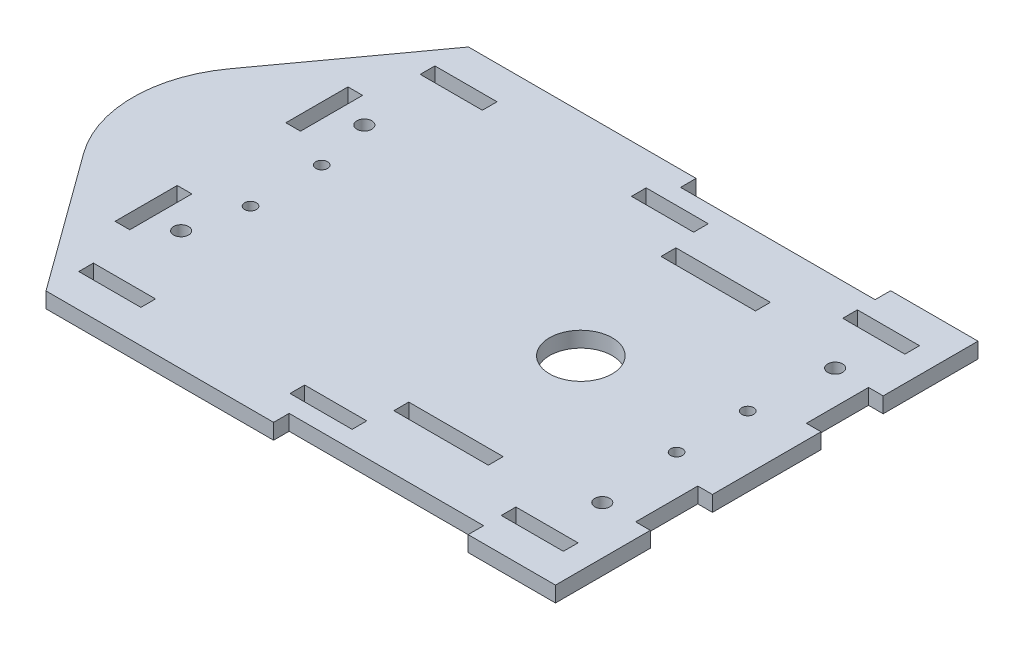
ISO-10303-21;
HEADER;
FILE_DESCRIPTION(('STEP AP214'),'2;1');
FILE_NAME('part.step','',(''),(''),'','','');
FILE_SCHEMA(('AUTOMOTIVE_DESIGN { 1 0 10303 214 1 1 1 1 }'));
ENDSEC;
DATA;
#1=APPLICATION_CONTEXT('core data for automotive mechanical design processes');
#2=APPLICATION_PROTOCOL_DEFINITION('international standard','automotive_design',2000,#1);
#3=PRODUCT_CONTEXT('',#1,'mechanical');
#4=PRODUCT('Part','Part','',(#3));
#5=PRODUCT_RELATED_PRODUCT_CATEGORY('part','',(#4));
#6=PRODUCT_DEFINITION_FORMATION('','',#4);
#7=PRODUCT_DEFINITION_CONTEXT('part definition',#1,'design');
#8=PRODUCT_DEFINITION('design','',#6,#7);
#9=PRODUCT_DEFINITION_SHAPE('','',#8);
#10=(LENGTH_UNIT() NAMED_UNIT(*) SI_UNIT(.MILLI.,.METRE.));
#11=(NAMED_UNIT(*) PLANE_ANGLE_UNIT() SI_UNIT($,.RADIAN.));
#12=(NAMED_UNIT(*) SI_UNIT($,.STERADIAN.) SOLID_ANGLE_UNIT());
#13=UNCERTAINTY_MEASURE_WITH_UNIT(LENGTH_MEASURE(1.E-05),#10,'distance_accuracy_value','');
#14=(GEOMETRIC_REPRESENTATION_CONTEXT(3) GLOBAL_UNCERTAINTY_ASSIGNED_CONTEXT((#13)) GLOBAL_UNIT_ASSIGNED_CONTEXT((#10,
#11,#12)) REPRESENTATION_CONTEXT('',''));
#15=CARTESIAN_POINT('',(0.,0.,0.));
#16=DIRECTION('',(0.,0.,1.));
#17=DIRECTION('',(1.,0.,0.));
#18=AXIS2_PLACEMENT_3D('',#15,#16,#17);
#19=CARTESIAN_POINT('',(-98.1786679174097,3.175,23.8349539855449));
#20=DIRECTION('',(-0.80873718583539,0.,-0.588170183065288));
#21=DIRECTION('',(-0.588170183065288,0.,0.80873718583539));
#22=AXIS2_PLACEMENT_3D('',#19,#20,#21);
#23=PLANE('',#22);
#24=DIRECTION('',(0.588170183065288,0.,-0.80873718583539));
#25=VECTOR('',#24,1.);
#26=CARTESIAN_POINT('',(-98.1786679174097,0.,23.8349539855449));
#27=LINE('',#26,#25);
#28=CARTESIAN_POINT('',(-69.979159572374,0.,-14.9395226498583));
#29=VERTEX_POINT('',#28);
#30=CARTESIAN_POINT('',(-49.4407114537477,0.,-43.18));
#31=VERTEX_POINT('',#30);
#32=EDGE_CURVE('E812',#29,#31,#27,.T.);
#33=ORIENTED_EDGE('',*,*,#32,.F.);
#34=DIRECTION('',(0.,-1.,0.));
#35=VECTOR('',#34,1.);
#36=CARTESIAN_POINT('',(-69.979159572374,3.175,-14.9395226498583));
#37=LINE('',#36,#35);
#38=CARTESIAN_POINT('',(-69.979159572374,3.175,-14.9395226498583));
#39=VERTEX_POINT('',#38);
#40=EDGE_CURVE('E11',#39,#29,#37,.T.);
#41=ORIENTED_EDGE('',*,*,#40,.F.);
#42=DIRECTION('',(0.588170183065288,0.,-0.80873718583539));
#43=VECTOR('',#42,1.);
#44=CARTESIAN_POINT('',(-98.1786679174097,3.175,23.8349539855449));
#45=LINE('',#44,#43);
#46=CARTESIAN_POINT('',(-49.4407114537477,3.175,-43.18));
#47=VERTEX_POINT('',#46);
#48=EDGE_CURVE('E641',#39,#47,#45,.T.);
#49=ORIENTED_EDGE('',*,*,#48,.T.);
#50=DIRECTION('',(0.,-1.,0.));
#51=VECTOR('',#50,1.);
#52=CARTESIAN_POINT('',(-49.4407114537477,3.175,-43.18));
#53=LINE('',#52,#51);
#54=EDGE_CURVE('E869',#47,#31,#53,.T.);
#55=ORIENTED_EDGE('',*,*,#54,.T.);
#56=EDGE_LOOP('',(#33,#41,#49,#55));
#57=FACE_BOUND('',#56,.T.);
#58=ADVANCED_FACE('F31',(#57),#23,.T.);
#59=CARTESIAN_POINT('',(-49.4372350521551,3.175,0.));
#60=DIRECTION('',(0.,-1.,0.));
#61=DIRECTION('',(0.,0.,-1.));
#62=AXIS2_PLACEMENT_3D('',#59,#60,#61);
#63=CYLINDRICAL_SURFACE('',#62,25.4);
#64=CARTESIAN_POINT('',(-49.4372350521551,0.,0.));
#65=DIRECTION('',(0.,1.,0.));
#66=DIRECTION('',(0.,0.,1.));
#67=AXIS2_PLACEMENT_3D('',#64,#65,#66);
#68=CIRCLE('',#67,25.4);
#69=CARTESIAN_POINT('',(-69.979159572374,0.,14.9395226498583));
#70=VERTEX_POINT('',#69);
#71=EDGE_CURVE('E815',#29,#70,#68,.T.);
#72=ORIENTED_EDGE('',*,*,#71,.T.);
#73=DIRECTION('',(0.,-1.,0.));
#74=VECTOR('',#73,1.);
#75=CARTESIAN_POINT('',(-69.979159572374,3.175,14.9395226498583));
#76=LINE('',#75,#74);
#77=CARTESIAN_POINT('',(-69.979159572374,3.175,14.9395226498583));
#78=VERTEX_POINT('',#77);
#79=EDGE_CURVE('E40',#78,#70,#76,.T.);
#80=ORIENTED_EDGE('',*,*,#79,.F.);
#81=CARTESIAN_POINT('',(-49.4372350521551,3.175,0.));
#82=DIRECTION('',(0.,1.,0.));
#83=DIRECTION('',(0.,0.,1.));
#84=AXIS2_PLACEMENT_3D('',#81,#82,#83);
#85=CIRCLE('',#84,25.4);
#86=EDGE_CURVE('E644',#39,#78,#85,.T.);
#87=ORIENTED_EDGE('',*,*,#86,.F.);
#88=ORIENTED_EDGE('',*,*,#40,.T.);
#89=EDGE_LOOP('',(#72,#80,#87,#88));
#90=FACE_BOUND('',#89,.T.);
#91=ADVANCED_FACE('F999',(#90),#63,.T.);
#92=CARTESIAN_POINT('',(-98.1786679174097,3.175,-23.8349539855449));
#93=DIRECTION('',(0.80873718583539,0.,-0.588170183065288));
#94=DIRECTION('',(-0.588170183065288,0.,-0.80873718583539));
#95=AXIS2_PLACEMENT_3D('',#92,#93,#94);
#96=PLANE('',#95);
#97=DIRECTION('',(0.588170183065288,0.,0.80873718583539));
#98=VECTOR('',#97,1.);
#99=CARTESIAN_POINT('',(-98.1786679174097,0.,-23.8349539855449));
#100=LINE('',#99,#98);
#101=CARTESIAN_POINT('',(-49.4407114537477,0.,43.18));
#102=VERTEX_POINT('',#101);
#103=EDGE_CURVE('E818',#70,#102,#100,.T.);
#104=ORIENTED_EDGE('',*,*,#103,.T.);
#105=DIRECTION('',(0.,-1.,0.));
#106=VECTOR('',#105,1.);
#107=CARTESIAN_POINT('',(-49.4407114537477,3.175,43.18));
#108=LINE('',#107,#106);
#109=CARTESIAN_POINT('',(-49.4407114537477,3.175,43.18));
#110=VERTEX_POINT('',#109);
#111=EDGE_CURVE('E897',#110,#102,#108,.T.);
#112=ORIENTED_EDGE('',*,*,#111,.F.);
#113=DIRECTION('',(0.588170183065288,0.,0.80873718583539));
#114=VECTOR('',#113,1.);
#115=CARTESIAN_POINT('',(-98.1786679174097,3.175,-23.8349539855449));
#116=LINE('',#115,#114);
#117=EDGE_CURVE('E647',#78,#110,#116,.T.);
#118=ORIENTED_EDGE('',*,*,#117,.F.);
#119=ORIENTED_EDGE('',*,*,#79,.T.);
#120=EDGE_LOOP('',(#104,#112,#118,#119));
#121=FACE_BOUND('',#120,.T.);
#122=ADVANCED_FACE('F1005',(#121),#96,.F.);
#123=CARTESIAN_POINT('',(-130.951858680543,3.175,43.18));
#124=DIRECTION('',(0.,0.,1.));
#125=DIRECTION('',(1.,0.,0.));
#126=AXIS2_PLACEMENT_3D('',#123,#124,#125);
#127=PLANE('',#126);
#128=DIRECTION('',(0.,1.,0.));
#129=VECTOR('',#128,1.);
#130=CARTESIAN_POINT('',(-2.91993778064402,0.,43.18));
#131=LINE('',#130,#129);
#132=CARTESIAN_POINT('',(-2.91993778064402,0.,43.18));
#133=VERTEX_POINT('',#132);
#134=CARTESIAN_POINT('',(-2.91993778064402,3.175,43.18));
#135=VERTEX_POINT('',#134);
#136=EDGE_CURVE('E526',#133,#135,#131,.T.);
#137=ORIENTED_EDGE('',*,*,#136,.T.);
#138=DIRECTION('',(-1.,0.,0.));
#139=VECTOR('',#138,1.);
#140=CARTESIAN_POINT('',(-130.951858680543,3.175,43.18));
#141=LINE('',#140,#139);
#142=EDGE_CURVE('E650',#135,#110,#141,.T.);
#143=ORIENTED_EDGE('',*,*,#142,.T.);
#144=ORIENTED_EDGE('',*,*,#111,.T.);
#145=DIRECTION('',(-1.,0.,0.));
#146=VECTOR('',#145,1.);
#147=CARTESIAN_POINT('',(-130.951858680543,0.,43.18));
#148=LINE('',#147,#146);
#149=EDGE_CURVE('E821',#133,#102,#148,.T.);
#150=ORIENTED_EDGE('',*,*,#149,.F.);
#151=EDGE_LOOP('',(#137,#143,#144,#150));
#152=FACE_BOUND('',#151,.T.);
#153=ADVANCED_FACE('F1244',(#152),#127,.T.);
#154=CARTESIAN_POINT('',(-130.951858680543,3.175,40.005));
#155=DIRECTION('',(0.,0.,1.));
#156=DIRECTION('',(1.,0.,0.));
#157=AXIS2_PLACEMENT_3D('',#154,#155,#156);
#158=PLANE('',#157);
#159=DIRECTION('',(-1.,0.,0.));
#160=VECTOR('',#159,1.);
#161=CARTESIAN_POINT('',(-130.951858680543,0.,40.005));
#162=LINE('',#161,#160);
#163=CARTESIAN_POINT('',(36.8382070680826,0.,40.005));
#164=VERTEX_POINT('',#163);
#165=CARTESIAN_POINT('',(-2.91993778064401,0.,40.005));
#166=VERTEX_POINT('',#165);
#167=EDGE_CURVE('E823',#164,#166,#162,.T.);
#168=ORIENTED_EDGE('',*,*,#167,.F.);
#169=DIRECTION('',(0.,1.,0.));
#170=VECTOR('',#169,1.);
#171=CARTESIAN_POINT('',(36.8382070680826,0.,40.005));
#172=LINE('',#171,#170);
#173=CARTESIAN_POINT('',(36.8382070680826,3.175,40.005));
#174=VERTEX_POINT('',#173);
#175=EDGE_CURVE('E519',#164,#174,#172,.T.);
#176=ORIENTED_EDGE('',*,*,#175,.T.);
#177=DIRECTION('',(-1.,0.,0.));
#178=VECTOR('',#177,1.);
#179=CARTESIAN_POINT('',(-130.951858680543,3.175,40.005));
#180=LINE('',#179,#178);
#181=CARTESIAN_POINT('',(-2.91993778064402,3.175,40.005));
#182=VERTEX_POINT('',#181);
#183=EDGE_CURVE('E652',#174,#182,#180,.T.);
#184=ORIENTED_EDGE('',*,*,#183,.T.);
#185=DIRECTION('',(0.,1.,0.));
#186=VECTOR('',#185,1.);
#187=CARTESIAN_POINT('',(-2.91993778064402,0.,40.005));
#188=LINE('',#187,#186);
#189=EDGE_CURVE('E529',#166,#182,#188,.T.);
#190=ORIENTED_EDGE('',*,*,#189,.F.);
#191=EDGE_LOOP('',(#168,#176,#184,#190));
#192=FACE_BOUND('',#191,.T.);
#193=ADVANCED_FACE('F1240',(#192),#158,.T.);
#194=CARTESIAN_POINT('',(-130.951858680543,3.175,43.1799999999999));
#195=DIRECTION('',(0.,0.,-1.));
#196=DIRECTION('',(-1.,0.,0.));
#197=AXIS2_PLACEMENT_3D('',#194,#195,#196);
#198=PLANE('',#197);
#199=DIRECTION('',(1.,0.,0.));
#200=VECTOR('',#199,1.);
#201=CARTESIAN_POINT('',(-130.951858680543,3.175,43.1799999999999));
#202=LINE('',#201,#200);
#203=CARTESIAN_POINT('',(36.8382070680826,3.175,43.18));
#204=VERTEX_POINT('',#203);
#205=CARTESIAN_POINT('',(54.6992885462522,3.175,43.18));
#206=VERTEX_POINT('',#205);
#207=EDGE_CURVE('E654',#204,#206,#202,.T.);
#208=ORIENTED_EDGE('',*,*,#207,.F.);
#209=DIRECTION('',(0.,1.,0.));
#210=VECTOR('',#209,1.);
#211=CARTESIAN_POINT('',(36.8382070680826,0.,43.18));
#212=LINE('',#211,#210);
#213=CARTESIAN_POINT('',(36.8382070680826,0.,43.18));
#214=VERTEX_POINT('',#213);
#215=EDGE_CURVE('E523',#214,#204,#212,.T.);
#216=ORIENTED_EDGE('',*,*,#215,.F.);
#217=DIRECTION('',(1.,0.,0.));
#218=VECTOR('',#217,1.);
#219=CARTESIAN_POINT('',(-130.951858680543,0.,43.1799999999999));
#220=LINE('',#219,#218);
#221=CARTESIAN_POINT('',(54.6992885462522,0.,43.18));
#222=VERTEX_POINT('',#221);
#223=EDGE_CURVE('E825',#214,#222,#220,.T.);
#224=ORIENTED_EDGE('',*,*,#223,.T.);
#225=DIRECTION('',(0.,-1.,0.));
#226=VECTOR('',#225,1.);
#227=CARTESIAN_POINT('',(54.6992885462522,3.175,43.18));
#228=LINE('',#227,#226);
#229=EDGE_CURVE('E894',#206,#222,#228,.T.);
#230=ORIENTED_EDGE('',*,*,#229,.F.);
#231=EDGE_LOOP('',(#208,#216,#224,#230));
#232=FACE_BOUND('',#231,.T.);
#233=ADVANCED_FACE('F1236',(#232),#198,.F.);
#234=CARTESIAN_POINT('',(54.6992885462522,3.175,0.));
#235=DIRECTION('',(1.,0.,0.));
#236=DIRECTION('',(0.,0.,-1.));
#237=AXIS2_PLACEMENT_3D('',#234,#235,#236);
#238=PLANE('',#237);
#239=DIRECTION('',(0.,0.,1.));
#240=VECTOR('',#239,1.);
#241=CARTESIAN_POINT('',(54.6992885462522,0.,0.));
#242=LINE('',#241,#240);
#243=CARTESIAN_POINT('',(54.6992885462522,0.,23.7998));
#244=VERTEX_POINT('',#243);
#245=EDGE_CURVE('E827',#244,#222,#242,.T.);
#246=ORIENTED_EDGE('',*,*,#245,.F.);
#247=DIRECTION('',(0.,-1.,0.));
#248=VECTOR('',#247,1.);
#249=CARTESIAN_POINT('',(54.6992885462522,3.175,23.7998));
#250=LINE('',#249,#248);
#251=CARTESIAN_POINT('',(54.6992885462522,3.175,23.7998));
#252=VERTEX_POINT('',#251);
#253=EDGE_CURVE('E892',#252,#244,#250,.T.);
#254=ORIENTED_EDGE('',*,*,#253,.F.);
#255=DIRECTION('',(0.,0.,1.));
#256=VECTOR('',#255,1.);
#257=CARTESIAN_POINT('',(54.6992885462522,3.175,0.));
#258=LINE('',#257,#256);
#259=EDGE_CURVE('E656',#252,#206,#258,.T.);
#260=ORIENTED_EDGE('',*,*,#259,.T.);
#261=ORIENTED_EDGE('',*,*,#229,.T.);
#262=EDGE_LOOP('',(#246,#254,#260,#261));
#263=FACE_BOUND('',#262,.T.);
#264=ADVANCED_FACE('F1232',(#263),#238,.T.);
#265=CARTESIAN_POINT('',(-130.951858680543,3.175,23.7997999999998));
#266=DIRECTION('',(0.,0.,-1.));
#267=DIRECTION('',(-1.,0.,0.));
#268=AXIS2_PLACEMENT_3D('',#265,#266,#267);
#269=PLANE('',#268);
#270=DIRECTION('',(1.,0.,0.));
#271=VECTOR('',#270,1.);
#272=CARTESIAN_POINT('',(-130.951858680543,0.,23.7997999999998));
#273=LINE('',#272,#271);
#274=CARTESIAN_POINT('',(51.7020885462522,0.,23.7998));
#275=VERTEX_POINT('',#274);
#276=EDGE_CURVE('E830',#275,#244,#273,.T.);
#277=ORIENTED_EDGE('',*,*,#276,.F.);
#278=DIRECTION('',(0.,-1.,0.));
#279=VECTOR('',#278,1.);
#280=CARTESIAN_POINT('',(51.7020885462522,3.175,23.7998));
#281=LINE('',#280,#279);
#282=CARTESIAN_POINT('',(51.7020885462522,3.175,23.7998));
#283=VERTEX_POINT('',#282);
#284=EDGE_CURVE('E890',#283,#275,#281,.T.);
#285=ORIENTED_EDGE('',*,*,#284,.F.);
#286=DIRECTION('',(1.,0.,0.));
#287=VECTOR('',#286,1.);
#288=CARTESIAN_POINT('',(-130.951858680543,3.175,23.7997999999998));
#289=LINE('',#288,#287);
#290=EDGE_CURVE('E659',#283,#252,#289,.T.);
#291=ORIENTED_EDGE('',*,*,#290,.T.);
#292=ORIENTED_EDGE('',*,*,#253,.T.);
#293=EDGE_LOOP('',(#277,#285,#291,#292));
#294=FACE_BOUND('',#293,.T.);
#295=ADVANCED_FACE('F1228',(#294),#269,.T.);
#296=CARTESIAN_POINT('',(51.7020885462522,3.175,0.));
#297=DIRECTION('',(-1.,0.,0.));
#298=DIRECTION('',(0.,0.,1.));
#299=AXIS2_PLACEMENT_3D('',#296,#297,#298);
#300=PLANE('',#299);
#301=DIRECTION('',(0.,0.,-1.));
#302=VECTOR('',#301,1.);
#303=CARTESIAN_POINT('',(51.7020885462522,0.,0.));
#304=LINE('',#303,#302);
#305=CARTESIAN_POINT('',(51.7020885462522,0.,11.0998));
#306=VERTEX_POINT('',#305);
#307=EDGE_CURVE('E833',#275,#306,#304,.T.);
#308=ORIENTED_EDGE('',*,*,#307,.T.);
#309=DIRECTION('',(0.,-1.,0.));
#310=VECTOR('',#309,1.);
#311=CARTESIAN_POINT('',(51.7020885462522,3.175,11.0998));
#312=LINE('',#311,#310);
#313=CARTESIAN_POINT('',(51.7020885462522,3.175,11.0998));
#314=VERTEX_POINT('',#313);
#315=EDGE_CURVE('E887',#314,#306,#312,.T.);
#316=ORIENTED_EDGE('',*,*,#315,.F.);
#317=DIRECTION('',(0.,0.,-1.));
#318=VECTOR('',#317,1.);
#319=CARTESIAN_POINT('',(51.7020885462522,3.175,0.));
#320=LINE('',#319,#318);
#321=EDGE_CURVE('E662',#283,#314,#320,.T.);
#322=ORIENTED_EDGE('',*,*,#321,.F.);
#323=ORIENTED_EDGE('',*,*,#284,.T.);
#324=EDGE_LOOP('',(#308,#316,#322,#323));
#325=FACE_BOUND('',#324,.T.);
#326=ADVANCED_FACE('F1224',(#325),#300,.F.);
#327=CARTESIAN_POINT('',(-130.951858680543,3.175,11.0997999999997));
#328=DIRECTION('',(0.,0.,-1.));
#329=DIRECTION('',(-1.,0.,0.));
#330=AXIS2_PLACEMENT_3D('',#327,#328,#329);
#331=PLANE('',#330);
#332=DIRECTION('',(1.,0.,0.));
#333=VECTOR('',#332,1.);
#334=CARTESIAN_POINT('',(-130.951858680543,0.,11.0997999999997));
#335=LINE('',#334,#333);
#336=CARTESIAN_POINT('',(54.6992885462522,0.,11.0998));
#337=VERTEX_POINT('',#336);
#338=EDGE_CURVE('E836',#306,#337,#335,.T.);
#339=ORIENTED_EDGE('',*,*,#338,.T.);
#340=DIRECTION('',(0.,-1.,0.));
#341=VECTOR('',#340,1.);
#342=CARTESIAN_POINT('',(54.6992885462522,3.175,11.0998));
#343=LINE('',#342,#341);
#344=CARTESIAN_POINT('',(54.6992885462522,3.175,11.0998));
#345=VERTEX_POINT('',#344);
#346=EDGE_CURVE('E884',#345,#337,#343,.T.);
#347=ORIENTED_EDGE('',*,*,#346,.F.);
#348=DIRECTION('',(1.,0.,0.));
#349=VECTOR('',#348,1.);
#350=CARTESIAN_POINT('',(-130.951858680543,3.175,11.0997999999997));
#351=LINE('',#350,#349);
#352=EDGE_CURVE('E665',#314,#345,#351,.T.);
#353=ORIENTED_EDGE('',*,*,#352,.F.);
#354=ORIENTED_EDGE('',*,*,#315,.T.);
#355=EDGE_LOOP('',(#339,#347,#353,#354));
#356=FACE_BOUND('',#355,.T.);
#357=ADVANCED_FACE('F1220',(#356),#331,.F.);
#358=CARTESIAN_POINT('',(54.6992885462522,3.175,0.));
#359=DIRECTION('',(-1.,0.,0.));
#360=DIRECTION('',(0.,0.,1.));
#361=AXIS2_PLACEMENT_3D('',#358,#359,#360);
#362=PLANE('',#361);
#363=DIRECTION('',(0.,0.,-1.));
#364=VECTOR('',#363,1.);
#365=CARTESIAN_POINT('',(54.6992885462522,0.,0.));
#366=LINE('',#365,#364);
#367=CARTESIAN_POINT('',(54.6992885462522,0.,-11.0998));
#368=VERTEX_POINT('',#367);
#369=EDGE_CURVE('E839',#337,#368,#366,.T.);
#370=ORIENTED_EDGE('',*,*,#369,.T.);
#371=DIRECTION('',(0.,-1.,0.));
#372=VECTOR('',#371,1.);
#373=CARTESIAN_POINT('',(54.6992885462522,3.175,-11.0998));
#374=LINE('',#373,#372);
#375=CARTESIAN_POINT('',(54.6992885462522,3.175,-11.0998));
#376=VERTEX_POINT('',#375);
#377=EDGE_CURVE('E882',#376,#368,#374,.T.);
#378=ORIENTED_EDGE('',*,*,#377,.F.);
#379=DIRECTION('',(0.,0.,-1.));
#380=VECTOR('',#379,1.);
#381=CARTESIAN_POINT('',(54.6992885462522,3.175,0.));
#382=LINE('',#381,#380);
#383=EDGE_CURVE('E668',#345,#376,#382,.T.);
#384=ORIENTED_EDGE('',*,*,#383,.F.);
#385=ORIENTED_EDGE('',*,*,#346,.T.);
#386=EDGE_LOOP('',(#370,#378,#384,#385));
#387=FACE_BOUND('',#386,.T.);
#388=ADVANCED_FACE('F1216',(#387),#362,.F.);
#389=CARTESIAN_POINT('',(-130.951858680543,3.175,-11.0997999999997));
#390=DIRECTION('',(0.,0.,-1.));
#391=DIRECTION('',(-1.,0.,0.));
#392=AXIS2_PLACEMENT_3D('',#389,#390,#391);
#393=PLANE('',#392);
#394=DIRECTION('',(1.,0.,0.));
#395=VECTOR('',#394,1.);
#396=CARTESIAN_POINT('',(-130.951858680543,0.,-11.0997999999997));
#397=LINE('',#396,#395);
#398=CARTESIAN_POINT('',(51.7020885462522,0.,-11.0998));
#399=VERTEX_POINT('',#398);
#400=EDGE_CURVE('E842',#399,#368,#397,.T.);
#401=ORIENTED_EDGE('',*,*,#400,.F.);
#402=DIRECTION('',(0.,-1.,0.));
#403=VECTOR('',#402,1.);
#404=CARTESIAN_POINT('',(51.7020885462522,3.175,-11.0998));
#405=LINE('',#404,#403);
#406=CARTESIAN_POINT('',(51.7020885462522,3.175,-11.0998));
#407=VERTEX_POINT('',#406);
#408=EDGE_CURVE('E880',#407,#399,#405,.T.);
#409=ORIENTED_EDGE('',*,*,#408,.F.);
#410=DIRECTION('',(1.,0.,0.));
#411=VECTOR('',#410,1.);
#412=CARTESIAN_POINT('',(-130.951858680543,3.175,-11.0997999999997));
#413=LINE('',#412,#411);
#414=EDGE_CURVE('E670',#407,#376,#413,.T.);
#415=ORIENTED_EDGE('',*,*,#414,.T.);
#416=ORIENTED_EDGE('',*,*,#377,.T.);
#417=EDGE_LOOP('',(#401,#409,#415,#416));
#418=FACE_BOUND('',#417,.T.);
#419=ADVANCED_FACE('F1212',(#418),#393,.T.);
#420=CARTESIAN_POINT('',(51.7020885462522,3.175,0.));
#421=DIRECTION('',(1.,0.,0.));
#422=DIRECTION('',(0.,0.,-1.));
#423=AXIS2_PLACEMENT_3D('',#420,#421,#422);
#424=PLANE('',#423);
#425=DIRECTION('',(0.,0.,1.));
#426=VECTOR('',#425,1.);
#427=CARTESIAN_POINT('',(51.7020885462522,0.,0.));
#428=LINE('',#427,#426);
#429=CARTESIAN_POINT('',(51.7020885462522,0.,-23.7998));
#430=VERTEX_POINT('',#429);
#431=EDGE_CURVE('E845',#430,#399,#428,.T.);
#432=ORIENTED_EDGE('',*,*,#431,.F.);
#433=DIRECTION('',(0.,-1.,0.));
#434=VECTOR('',#433,1.);
#435=CARTESIAN_POINT('',(51.7020885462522,3.175,-23.7998));
#436=LINE('',#435,#434);
#437=CARTESIAN_POINT('',(51.7020885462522,3.175,-23.7998));
#438=VERTEX_POINT('',#437);
#439=EDGE_CURVE('E878',#438,#430,#436,.T.);
#440=ORIENTED_EDGE('',*,*,#439,.F.);
#441=DIRECTION('',(0.,0.,1.));
#442=VECTOR('',#441,1.);
#443=CARTESIAN_POINT('',(51.7020885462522,3.175,0.));
#444=LINE('',#443,#442);
#445=EDGE_CURVE('E673',#438,#407,#444,.T.);
#446=ORIENTED_EDGE('',*,*,#445,.T.);
#447=ORIENTED_EDGE('',*,*,#408,.T.);
#448=EDGE_LOOP('',(#432,#440,#446,#447));
#449=FACE_BOUND('',#448,.T.);
#450=ADVANCED_FACE('F1208',(#449),#424,.T.);
#451=CARTESIAN_POINT('',(-130.951858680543,3.175,-23.7997999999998));
#452=DIRECTION('',(0.,0.,-1.));
#453=DIRECTION('',(-1.,0.,0.));
#454=AXIS2_PLACEMENT_3D('',#451,#452,#453);
#455=PLANE('',#454);
#456=DIRECTION('',(1.,0.,0.));
#457=VECTOR('',#456,1.);
#458=CARTESIAN_POINT('',(-130.951858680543,0.,-23.7997999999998));
#459=LINE('',#458,#457);
#460=CARTESIAN_POINT('',(54.6992885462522,0.,-23.7998));
#461=VERTEX_POINT('',#460);
#462=EDGE_CURVE('E848',#430,#461,#459,.T.);
#463=ORIENTED_EDGE('',*,*,#462,.T.);
#464=DIRECTION('',(0.,-1.,0.));
#465=VECTOR('',#464,1.);
#466=CARTESIAN_POINT('',(54.6992885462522,3.175,-23.7998));
#467=LINE('',#466,#465);
#468=CARTESIAN_POINT('',(54.6992885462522,3.175,-23.7998));
#469=VERTEX_POINT('',#468);
#470=EDGE_CURVE('E875',#469,#461,#467,.T.);
#471=ORIENTED_EDGE('',*,*,#470,.F.);
#472=DIRECTION('',(1.,0.,0.));
#473=VECTOR('',#472,1.);
#474=CARTESIAN_POINT('',(-130.951858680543,3.175,-23.7997999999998));
#475=LINE('',#474,#473);
#476=EDGE_CURVE('E676',#438,#469,#475,.T.);
#477=ORIENTED_EDGE('',*,*,#476,.F.);
#478=ORIENTED_EDGE('',*,*,#439,.T.);
#479=EDGE_LOOP('',(#463,#471,#477,#478));
#480=FACE_BOUND('',#479,.T.);
#481=ADVANCED_FACE('F1204',(#480),#455,.F.);
#482=CARTESIAN_POINT('',(54.6992885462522,3.175,0.));
#483=DIRECTION('',(-1.,0.,0.));
#484=DIRECTION('',(0.,0.,1.));
#485=AXIS2_PLACEMENT_3D('',#482,#483,#484);
#486=PLANE('',#485);
#487=DIRECTION('',(0.,0.,-1.));
#488=VECTOR('',#487,1.);
#489=CARTESIAN_POINT('',(54.6992885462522,0.,0.));
#490=LINE('',#489,#488);
#491=CARTESIAN_POINT('',(54.6992885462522,0.,-43.18));
#492=VERTEX_POINT('',#491);
#493=EDGE_CURVE('E851',#461,#492,#490,.T.);
#494=ORIENTED_EDGE('',*,*,#493,.T.);
#495=DIRECTION('',(0.,-1.,0.));
#496=VECTOR('',#495,1.);
#497=CARTESIAN_POINT('',(54.6992885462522,3.175,-43.18));
#498=LINE('',#497,#496);
#499=CARTESIAN_POINT('',(54.6992885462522,3.175,-43.18));
#500=VERTEX_POINT('',#499);
#501=EDGE_CURVE('E871',#500,#492,#498,.T.);
#502=ORIENTED_EDGE('',*,*,#501,.F.);
#503=DIRECTION('',(0.,0.,-1.));
#504=VECTOR('',#503,1.);
#505=CARTESIAN_POINT('',(54.6992885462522,3.175,0.));
#506=LINE('',#505,#504);
#507=EDGE_CURVE('E679',#469,#500,#506,.T.);
#508=ORIENTED_EDGE('',*,*,#507,.F.);
#509=ORIENTED_EDGE('',*,*,#470,.T.);
#510=EDGE_LOOP('',(#494,#502,#508,#509));
#511=FACE_BOUND('',#510,.T.);
#512=ADVANCED_FACE('F1200',(#511),#486,.F.);
#513=CARTESIAN_POINT('',(-130.951858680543,3.175,-43.1799999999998));
#514=DIRECTION('',(0.,0.,-1.));
#515=DIRECTION('',(-1.,0.,0.));
#516=AXIS2_PLACEMENT_3D('',#513,#514,#515);
#517=PLANE('',#516);
#518=DIRECTION('',(0.,1.,0.));
#519=VECTOR('',#518,1.);
#520=CARTESIAN_POINT('',(36.8382070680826,0.,-43.18));
#521=LINE('',#520,#519);
#522=CARTESIAN_POINT('',(36.8382070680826,0.,-43.18));
#523=VERTEX_POINT('',#522);
#524=CARTESIAN_POINT('',(36.8382070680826,3.175,-43.18));
#525=VERTEX_POINT('',#524);
#526=EDGE_CURVE('E507',#523,#525,#521,.T.);
#527=ORIENTED_EDGE('',*,*,#526,.T.);
#528=DIRECTION('',(1.,0.,0.));
#529=VECTOR('',#528,1.);
#530=CARTESIAN_POINT('',(-130.951858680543,3.175,-43.1799999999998));
#531=LINE('',#530,#529);
#532=EDGE_CURVE('E682',#525,#500,#531,.T.);
#533=ORIENTED_EDGE('',*,*,#532,.T.);
#534=ORIENTED_EDGE('',*,*,#501,.T.);
#535=DIRECTION('',(1.,0.,0.));
#536=VECTOR('',#535,1.);
#537=CARTESIAN_POINT('',(-130.951858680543,0.,-43.1799999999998));
#538=LINE('',#537,#536);
#539=EDGE_CURVE('E854',#523,#492,#538,.T.);
#540=ORIENTED_EDGE('',*,*,#539,.F.);
#541=EDGE_LOOP('',(#527,#533,#534,#540));
#542=FACE_BOUND('',#541,.T.);
#543=ADVANCED_FACE('F1196',(#542),#517,.T.);
#544=CARTESIAN_POINT('',(-130.951858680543,3.175,-40.0049999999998));
#545=DIRECTION('',(0.,0.,-1.));
#546=DIRECTION('',(-1.,0.,0.));
#547=AXIS2_PLACEMENT_3D('',#544,#545,#546);
#548=PLANE('',#547);
#549=DIRECTION('',(1.,0.,0.));
#550=VECTOR('',#549,1.);
#551=CARTESIAN_POINT('',(-130.951858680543,0.,-40.0049999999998));
#552=LINE('',#551,#550);
#553=CARTESIAN_POINT('',(-2.91993778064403,0.,-40.005));
#554=VERTEX_POINT('',#553);
#555=CARTESIAN_POINT('',(36.8382070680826,0.,-40.005));
#556=VERTEX_POINT('',#555);
#557=EDGE_CURVE('E856',#554,#556,#552,.T.);
#558=ORIENTED_EDGE('',*,*,#557,.F.);
#559=DIRECTION('',(0.,1.,0.));
#560=VECTOR('',#559,1.);
#561=CARTESIAN_POINT('',(-2.91993778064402,0.,-40.005));
#562=LINE('',#561,#560);
#563=CARTESIAN_POINT('',(-2.91993778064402,3.175,-40.005));
#564=VERTEX_POINT('',#563);
#565=EDGE_CURVE('E501',#554,#564,#562,.T.);
#566=ORIENTED_EDGE('',*,*,#565,.T.);
#567=DIRECTION('',(1.,0.,0.));
#568=VECTOR('',#567,1.);
#569=CARTESIAN_POINT('',(-130.951858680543,3.175,-40.0049999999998));
#570=LINE('',#569,#568);
#571=CARTESIAN_POINT('',(36.8382070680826,3.175,-40.005));
#572=VERTEX_POINT('',#571);
#573=EDGE_CURVE('E684',#564,#572,#570,.T.);
#574=ORIENTED_EDGE('',*,*,#573,.T.);
#575=DIRECTION('',(0.,1.,0.));
#576=VECTOR('',#575,1.);
#577=CARTESIAN_POINT('',(36.8382070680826,0.,-40.005));
#578=LINE('',#577,#576);
#579=EDGE_CURVE('E497',#556,#572,#578,.T.);
#580=ORIENTED_EDGE('',*,*,#579,.F.);
#581=EDGE_LOOP('',(#558,#566,#574,#580));
#582=FACE_BOUND('',#581,.T.);
#583=ADVANCED_FACE('F1029',(#582),#548,.T.);
#584=CARTESIAN_POINT('',(-54.6992885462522,3.175,0.));
#585=DIRECTION('',(1.,0.,0.));
#586=DIRECTION('',(0.,0.,-1.));
#587=AXIS2_PLACEMENT_3D('',#584,#585,#586);
#588=PLANE('',#587);
#589=DIRECTION('',(0.,0.,1.));
#590=VECTOR('',#589,1.);
#591=CARTESIAN_POINT('',(-54.6992885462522,0.,0.));
#592=LINE('',#591,#590);
#593=CARTESIAN_POINT('',(-54.6992885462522,0.,-23.7998));
#594=VERTEX_POINT('',#593);
#595=CARTESIAN_POINT('',(-54.6992885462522,0.,-11.0998));
#596=VERTEX_POINT('',#595);
#597=EDGE_CURVE('E800',#594,#596,#592,.T.);
#598=ORIENTED_EDGE('',*,*,#597,.F.);
#599=DIRECTION('',(0.,-1.,0.));
#600=VECTOR('',#599,1.);
#601=CARTESIAN_POINT('',(-54.6992885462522,3.175,-23.7998));
#602=LINE('',#601,#600);
#603=CARTESIAN_POINT('',(-54.6992885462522,3.175,-23.7998));
#604=VERTEX_POINT('',#603);
#605=EDGE_CURVE('E872',#604,#594,#602,.T.);
#606=ORIENTED_EDGE('',*,*,#605,.F.);
#607=DIRECTION('',(0.,0.,1.));
#608=VECTOR('',#607,1.);
#609=CARTESIAN_POINT('',(-54.6992885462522,3.175,0.));
#610=LINE('',#609,#608);
#611=CARTESIAN_POINT('',(-54.6992885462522,3.175,-11.0998));
#612=VERTEX_POINT('',#611);
#613=EDGE_CURVE('E630',#604,#612,#610,.T.);
#614=ORIENTED_EDGE('',*,*,#613,.T.);
#615=DIRECTION('',(0.,-1.,0.));
#616=VECTOR('',#615,1.);
#617=CARTESIAN_POINT('',(-54.6992885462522,3.175,-11.0998));
#618=LINE('',#617,#616);
#619=EDGE_CURVE('E902',#612,#596,#618,.T.);
#620=ORIENTED_EDGE('',*,*,#619,.T.);
#621=EDGE_LOOP('',(#598,#606,#614,#620));
#622=FACE_BOUND('',#621,.T.);
#623=ADVANCED_FACE('F1025',(#622),#588,.T.);
#624=CARTESIAN_POINT('',(-130.951858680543,3.175,-23.7998000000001));
#625=DIRECTION('',(0.,0.,1.));
#626=DIRECTION('',(1.,0.,0.));
#627=AXIS2_PLACEMENT_3D('',#624,#625,#626);
#628=PLANE('',#627);
#629=DIRECTION('',(-1.,0.,0.));
#630=VECTOR('',#629,1.);
#631=CARTESIAN_POINT('',(-130.951858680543,0.,-23.7998000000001));
#632=LINE('',#631,#630);
#633=CARTESIAN_POINT('',(-51.7020885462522,0.,-23.7998));
#634=VERTEX_POINT('',#633);
#635=EDGE_CURVE('E803',#634,#594,#632,.T.);
#636=ORIENTED_EDGE('',*,*,#635,.F.);
#637=DIRECTION('',(0.,-1.,0.));
#638=VECTOR('',#637,1.);
#639=CARTESIAN_POINT('',(-51.7020885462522,3.175,-23.7998));
#640=LINE('',#639,#638);
#641=CARTESIAN_POINT('',(-51.7020885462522,3.175,-23.7998));
#642=VERTEX_POINT('',#641);
#643=EDGE_CURVE('E908',#642,#634,#640,.T.);
#644=ORIENTED_EDGE('',*,*,#643,.F.);
#645=DIRECTION('',(-1.,0.,0.));
#646=VECTOR('',#645,1.);
#647=CARTESIAN_POINT('',(-130.951858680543,3.175,-23.7998000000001));
#648=LINE('',#647,#646);
#649=EDGE_CURVE('E633',#642,#604,#648,.T.);
#650=ORIENTED_EDGE('',*,*,#649,.T.);
#651=ORIENTED_EDGE('',*,*,#605,.T.);
#652=EDGE_LOOP('',(#636,#644,#650,#651));
#653=FACE_BOUND('',#652,.T.);
#654=ADVANCED_FACE('F1021',(#653),#628,.T.);
#655=CARTESIAN_POINT('',(-51.7020885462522,3.175,0.));
#656=DIRECTION('',(1.,0.,0.));
#657=DIRECTION('',(0.,0.,-1.));
#658=AXIS2_PLACEMENT_3D('',#655,#656,#657);
#659=PLANE('',#658);
#660=DIRECTION('',(0.,0.,1.));
#661=VECTOR('',#660,1.);
#662=CARTESIAN_POINT('',(-51.7020885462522,0.,0.));
#663=LINE('',#662,#661);
#664=CARTESIAN_POINT('',(-51.7020885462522,0.,-11.0998));
#665=VERTEX_POINT('',#664);
#666=EDGE_CURVE('E806',#634,#665,#663,.T.);
#667=ORIENTED_EDGE('',*,*,#666,.T.);
#668=DIRECTION('',(0.,-1.,0.));
#669=VECTOR('',#668,1.);
#670=CARTESIAN_POINT('',(-51.7020885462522,3.175,-11.0998));
#671=LINE('',#670,#669);
#672=CARTESIAN_POINT('',(-51.7020885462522,3.175,-11.0998));
#673=VERTEX_POINT('',#672);
#674=EDGE_CURVE('E904',#673,#665,#671,.T.);
#675=ORIENTED_EDGE('',*,*,#674,.F.);
#676=DIRECTION('',(0.,0.,1.));
#677=VECTOR('',#676,1.);
#678=CARTESIAN_POINT('',(-51.7020885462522,3.175,0.));
#679=LINE('',#678,#677);
#680=EDGE_CURVE('E636',#642,#673,#679,.T.);
#681=ORIENTED_EDGE('',*,*,#680,.F.);
#682=ORIENTED_EDGE('',*,*,#643,.T.);
#683=EDGE_LOOP('',(#667,#675,#681,#682));
#684=FACE_BOUND('',#683,.T.);
#685=ADVANCED_FACE('F1017',(#684),#659,.F.);
#686=CARTESIAN_POINT('',(-130.951858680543,3.175,-33.401));
#687=DIRECTION('',(0.,0.,-1.));
#688=DIRECTION('',(-1.,0.,0.));
#689=AXIS2_PLACEMENT_3D('',#686,#687,#688);
#690=PLANE('',#689);
#691=DIRECTION('',(1.,0.,0.));
#692=VECTOR('',#691,1.);
#693=CARTESIAN_POINT('',(-130.951858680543,0.,-33.401));
#694=LINE('',#693,#692);
#695=CARTESIAN_POINT('',(-49.53,0.,-33.401));
#696=VERTEX_POINT('',#695);
#697=CARTESIAN_POINT('',(-36.83,0.,-33.401));
#698=VERTEX_POINT('',#697);
#699=EDGE_CURVE('E788',#696,#698,#694,.T.);
#700=ORIENTED_EDGE('',*,*,#699,.F.);
#701=DIRECTION('',(0.,-1.,0.));
#702=VECTOR('',#701,1.);
#703=CARTESIAN_POINT('',(-49.53,3.175,-33.401));
#704=LINE('',#703,#702);
#705=CARTESIAN_POINT('',(-49.53,3.175,-33.401));
#706=VERTEX_POINT('',#705);
#707=EDGE_CURVE('E905',#706,#696,#704,.T.);
#708=ORIENTED_EDGE('',*,*,#707,.F.);
#709=DIRECTION('',(1.,0.,0.));
#710=VECTOR('',#709,1.);
#711=CARTESIAN_POINT('',(-130.951858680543,3.175,-33.401));
#712=LINE('',#711,#710);
#713=CARTESIAN_POINT('',(-36.83,3.175,-33.401));
#714=VERTEX_POINT('',#713);
#715=EDGE_CURVE('E619',#706,#714,#712,.T.);
#716=ORIENTED_EDGE('',*,*,#715,.T.);
#717=DIRECTION('',(0.,-1.,0.));
#718=VECTOR('',#717,1.);
#719=CARTESIAN_POINT('',(-36.83,3.175,-33.401));
#720=LINE('',#719,#718);
#721=EDGE_CURVE('E911',#714,#698,#720,.T.);
#722=ORIENTED_EDGE('',*,*,#721,.T.);
#723=EDGE_LOOP('',(#700,#708,#716,#722));
#724=FACE_BOUND('',#723,.T.);
#725=ADVANCED_FACE('F1020',(#724),#690,.T.);
#726=CARTESIAN_POINT('',(-49.53,3.175,0.));
#727=DIRECTION('',(-1.,0.,0.));
#728=DIRECTION('',(0.,0.,1.));
#729=AXIS2_PLACEMENT_3D('',#726,#727,#728);
#730=PLANE('',#729);
#731=DIRECTION('',(0.,0.,-1.));
#732=VECTOR('',#731,1.);
#733=CARTESIAN_POINT('',(-49.53,0.,0.));
#734=LINE('',#733,#732);
#735=CARTESIAN_POINT('',(-49.53,0.,-36.3982));
#736=VERTEX_POINT('',#735);
#737=EDGE_CURVE('E791',#696,#736,#734,.T.);
#738=ORIENTED_EDGE('',*,*,#737,.T.);
#739=DIRECTION('',(0.,-1.,0.));
#740=VECTOR('',#739,1.);
#741=CARTESIAN_POINT('',(-49.53,3.175,-36.3982));
#742=LINE('',#741,#740);
#743=CARTESIAN_POINT('',(-49.53,3.175,-36.3982));
#744=VERTEX_POINT('',#743);
#745=EDGE_CURVE('E916',#744,#736,#742,.T.);
#746=ORIENTED_EDGE('',*,*,#745,.F.);
#747=DIRECTION('',(0.,0.,-1.));
#748=VECTOR('',#747,1.);
#749=CARTESIAN_POINT('',(-49.53,3.175,0.));
#750=LINE('',#749,#748);
#751=EDGE_CURVE('E622',#706,#744,#750,.T.);
#752=ORIENTED_EDGE('',*,*,#751,.F.);
#753=ORIENTED_EDGE('',*,*,#707,.T.);
#754=EDGE_LOOP('',(#738,#746,#752,#753));
#755=FACE_BOUND('',#754,.T.);
#756=ADVANCED_FACE('F1039',(#755),#730,.F.);
#757=CARTESIAN_POINT('',(-130.951858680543,3.175,-36.3982));
#758=DIRECTION('',(0.,0.,-1.));
#759=DIRECTION('',(-1.,0.,0.));
#760=AXIS2_PLACEMENT_3D('',#757,#758,#759);
#761=PLANE('',#760);
#762=DIRECTION('',(1.,0.,0.));
#763=VECTOR('',#762,1.);
#764=CARTESIAN_POINT('',(-130.951858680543,0.,-36.3982));
#765=LINE('',#764,#763);
#766=CARTESIAN_POINT('',(-36.83,0.,-36.3982));
#767=VERTEX_POINT('',#766);
#768=EDGE_CURVE('E794',#736,#767,#765,.T.);
#769=ORIENTED_EDGE('',*,*,#768,.T.);
#770=DIRECTION('',(0.,-1.,0.));
#771=VECTOR('',#770,1.);
#772=CARTESIAN_POINT('',(-36.83,3.175,-36.3982));
#773=LINE('',#772,#771);
#774=CARTESIAN_POINT('',(-36.83,3.175,-36.3982));
#775=VERTEX_POINT('',#774);
#776=EDGE_CURVE('E913',#775,#767,#773,.T.);
#777=ORIENTED_EDGE('',*,*,#776,.F.);
#778=DIRECTION('',(1.,0.,0.));
#779=VECTOR('',#778,1.);
#780=CARTESIAN_POINT('',(-130.951858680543,3.175,-36.3982));
#781=LINE('',#780,#779);
#782=EDGE_CURVE('E625',#744,#775,#781,.T.);
#783=ORIENTED_EDGE('',*,*,#782,.F.);
#784=ORIENTED_EDGE('',*,*,#745,.T.);
#785=EDGE_LOOP('',(#769,#777,#783,#784));
#786=FACE_BOUND('',#785,.T.);
#787=ADVANCED_FACE('F1035',(#786),#761,.F.);
#788=CARTESIAN_POINT('',(-130.951858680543,3.175,-33.401));
#789=DIRECTION('',(0.,0.,1.));
#790=DIRECTION('',(1.,0.,0.));
#791=AXIS2_PLACEMENT_3D('',#788,#789,#790);
#792=PLANE('',#791);
#793=DIRECTION('',(-1.,0.,0.));
#794=VECTOR('',#793,1.);
#795=CARTESIAN_POINT('',(-130.951858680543,0.,-33.401));
#796=LINE('',#795,#794);
#797=CARTESIAN_POINT('',(49.53,0.,-33.401));
#798=VERTEX_POINT('',#797);
#799=CARTESIAN_POINT('',(36.83,0.,-33.401));
#800=VERTEX_POINT('',#799);
#801=EDGE_CURVE('E776',#798,#800,#796,.T.);
#802=ORIENTED_EDGE('',*,*,#801,.T.);
#803=DIRECTION('',(0.,-1.,0.));
#804=VECTOR('',#803,1.);
#805=CARTESIAN_POINT('',(36.83,3.175,-33.401));
#806=LINE('',#805,#804);
#807=CARTESIAN_POINT('',(36.83,3.175,-33.401));
#808=VERTEX_POINT('',#807);
#809=EDGE_CURVE('E914',#808,#800,#806,.T.);
#810=ORIENTED_EDGE('',*,*,#809,.F.);
#811=DIRECTION('',(-1.,0.,0.));
#812=VECTOR('',#811,1.);
#813=CARTESIAN_POINT('',(-130.951858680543,3.175,-33.401));
#814=LINE('',#813,#812);
#815=CARTESIAN_POINT('',(49.53,3.175,-33.401));
#816=VERTEX_POINT('',#815);
#817=EDGE_CURVE('E608',#816,#808,#814,.T.);
#818=ORIENTED_EDGE('',*,*,#817,.F.);
#819=DIRECTION('',(0.,-1.,0.));
#820=VECTOR('',#819,1.);
#821=CARTESIAN_POINT('',(49.53,3.175,-33.401));
#822=LINE('',#821,#820);
#823=EDGE_CURVE('E920',#816,#798,#822,.T.);
#824=ORIENTED_EDGE('',*,*,#823,.T.);
#825=EDGE_LOOP('',(#802,#810,#818,#824));
#826=FACE_BOUND('',#825,.T.);
#827=ADVANCED_FACE('F1038',(#826),#792,.F.);
#828=CARTESIAN_POINT('',(36.83,3.175,0.));
#829=DIRECTION('',(-1.,0.,0.));
#830=DIRECTION('',(0.,0.,1.));
#831=AXIS2_PLACEMENT_3D('',#828,#829,#830);
#832=PLANE('',#831);
#833=DIRECTION('',(0.,0.,-1.));
#834=VECTOR('',#833,1.);
#835=CARTESIAN_POINT('',(36.83,0.,0.));
#836=LINE('',#835,#834);
#837=CARTESIAN_POINT('',(36.83,0.,-36.3982));
#838=VERTEX_POINT('',#837);
#839=EDGE_CURVE('E779',#800,#838,#836,.T.);
#840=ORIENTED_EDGE('',*,*,#839,.T.);
#841=DIRECTION('',(0.,-1.,0.));
#842=VECTOR('',#841,1.);
#843=CARTESIAN_POINT('',(36.83,3.175,-36.3982));
#844=LINE('',#843,#842);
#845=CARTESIAN_POINT('',(36.83,3.175,-36.3982));
#846=VERTEX_POINT('',#845);
#847=EDGE_CURVE('E925',#846,#838,#844,.T.);
#848=ORIENTED_EDGE('',*,*,#847,.F.);
#849=DIRECTION('',(0.,0.,-1.));
#850=VECTOR('',#849,1.);
#851=CARTESIAN_POINT('',(36.83,3.175,0.));
#852=LINE('',#851,#850);
#853=EDGE_CURVE('E611',#808,#846,#852,.T.);
#854=ORIENTED_EDGE('',*,*,#853,.F.);
#855=ORIENTED_EDGE('',*,*,#809,.T.);
#856=EDGE_LOOP('',(#840,#848,#854,#855));
#857=FACE_BOUND('',#856,.T.);
#858=ADVANCED_FACE('F1055',(#857),#832,.F.);
#859=CARTESIAN_POINT('',(-130.951858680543,3.175,-36.3982));
#860=DIRECTION('',(0.,0.,1.));
#861=DIRECTION('',(1.,0.,0.));
#862=AXIS2_PLACEMENT_3D('',#859,#860,#861);
#863=PLANE('',#862);
#864=DIRECTION('',(-1.,0.,0.));
#865=VECTOR('',#864,1.);
#866=CARTESIAN_POINT('',(-130.951858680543,0.,-36.3982));
#867=LINE('',#866,#865);
#868=CARTESIAN_POINT('',(49.53,0.,-36.3982));
#869=VERTEX_POINT('',#868);
#870=EDGE_CURVE('E782',#869,#838,#867,.T.);
#871=ORIENTED_EDGE('',*,*,#870,.F.);
#872=DIRECTION('',(0.,-1.,0.));
#873=VECTOR('',#872,1.);
#874=CARTESIAN_POINT('',(49.53,3.175,-36.3982));
#875=LINE('',#874,#873);
#876=CARTESIAN_POINT('',(49.53,3.175,-36.3982));
#877=VERTEX_POINT('',#876);
#878=EDGE_CURVE('E922',#877,#869,#875,.T.);
#879=ORIENTED_EDGE('',*,*,#878,.F.);
#880=DIRECTION('',(-1.,0.,0.));
#881=VECTOR('',#880,1.);
#882=CARTESIAN_POINT('',(-130.951858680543,3.175,-36.3982));
#883=LINE('',#882,#881);
#884=EDGE_CURVE('E613',#877,#846,#883,.T.);
#885=ORIENTED_EDGE('',*,*,#884,.T.);
#886=ORIENTED_EDGE('',*,*,#847,.T.);
#887=EDGE_LOOP('',(#871,#879,#885,#886));
#888=FACE_BOUND('',#887,.T.);
#889=ADVANCED_FACE('F1051',(#888),#863,.T.);
#890=CARTESIAN_POINT('',(-130.951858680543,3.175,33.401));
#891=DIRECTION('',(0.,0.,-1.));
#892=DIRECTION('',(-1.,0.,0.));
#893=AXIS2_PLACEMENT_3D('',#890,#891,#892);
#894=PLANE('',#893);
#895=DIRECTION('',(1.,0.,0.));
#896=VECTOR('',#895,1.);
#897=CARTESIAN_POINT('',(-130.951858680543,0.,33.401));
#898=LINE('',#897,#896);
#899=CARTESIAN_POINT('',(-49.53,0.,33.401));
#900=VERTEX_POINT('',#899);
#901=CARTESIAN_POINT('',(-36.83,0.,33.401));
#902=VERTEX_POINT('',#901);
#903=EDGE_CURVE('E764',#900,#902,#898,.T.);
#904=ORIENTED_EDGE('',*,*,#903,.T.);
#905=DIRECTION('',(0.,-1.,0.));
#906=VECTOR('',#905,1.);
#907=CARTESIAN_POINT('',(-36.83,3.175,33.401));
#908=LINE('',#907,#906);
#909=CARTESIAN_POINT('',(-36.83,3.175,33.401));
#910=VERTEX_POINT('',#909);
#911=EDGE_CURVE('E923',#910,#902,#908,.T.);
#912=ORIENTED_EDGE('',*,*,#911,.F.);
#913=DIRECTION('',(1.,0.,0.));
#914=VECTOR('',#913,1.);
#915=CARTESIAN_POINT('',(-130.951858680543,3.175,33.401));
#916=LINE('',#915,#914);
#917=CARTESIAN_POINT('',(-49.53,3.175,33.401));
#918=VERTEX_POINT('',#917);
#919=EDGE_CURVE('E597',#918,#910,#916,.T.);
#920=ORIENTED_EDGE('',*,*,#919,.F.);
#921=DIRECTION('',(0.,-1.,0.));
#922=VECTOR('',#921,1.);
#923=CARTESIAN_POINT('',(-49.53,3.175,33.401));
#924=LINE('',#923,#922);
#925=EDGE_CURVE('E929',#918,#900,#924,.T.);
#926=ORIENTED_EDGE('',*,*,#925,.T.);
#927=EDGE_LOOP('',(#904,#912,#920,#926));
#928=FACE_BOUND('',#927,.T.);
#929=ADVANCED_FACE('F1054',(#928),#894,.F.);
#930=CARTESIAN_POINT('',(-36.83,3.175,0.));
#931=DIRECTION('',(1.,0.,0.));
#932=DIRECTION('',(0.,0.,-1.));
#933=AXIS2_PLACEMENT_3D('',#930,#931,#932);
#934=PLANE('',#933);
#935=DIRECTION('',(0.,0.,1.));
#936=VECTOR('',#935,1.);
#937=CARTESIAN_POINT('',(-36.83,0.,0.));
#938=LINE('',#937,#936);
#939=CARTESIAN_POINT('',(-36.83,0.,36.3982));
#940=VERTEX_POINT('',#939);
#941=EDGE_CURVE('E767',#902,#940,#938,.T.);
#942=ORIENTED_EDGE('',*,*,#941,.T.);
#943=DIRECTION('',(0.,-1.,0.));
#944=VECTOR('',#943,1.);
#945=CARTESIAN_POINT('',(-36.83,3.175,36.3982));
#946=LINE('',#945,#944);
#947=CARTESIAN_POINT('',(-36.83,3.175,36.3982));
#948=VERTEX_POINT('',#947);
#949=EDGE_CURVE('E934',#948,#940,#946,.T.);
#950=ORIENTED_EDGE('',*,*,#949,.F.);
#951=DIRECTION('',(0.,0.,1.));
#952=VECTOR('',#951,1.);
#953=CARTESIAN_POINT('',(-36.83,3.175,0.));
#954=LINE('',#953,#952);
#955=EDGE_CURVE('E600',#910,#948,#954,.T.);
#956=ORIENTED_EDGE('',*,*,#955,.F.);
#957=ORIENTED_EDGE('',*,*,#911,.T.);
#958=EDGE_LOOP('',(#942,#950,#956,#957));
#959=FACE_BOUND('',#958,.T.);
#960=ADVANCED_FACE('F1071',(#959),#934,.F.);
#961=CARTESIAN_POINT('',(-130.951858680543,3.175,36.3982));
#962=DIRECTION('',(0.,0.,-1.));
#963=DIRECTION('',(-1.,0.,0.));
#964=AXIS2_PLACEMENT_3D('',#961,#962,#963);
#965=PLANE('',#964);
#966=DIRECTION('',(1.,0.,0.));
#967=VECTOR('',#966,1.);
#968=CARTESIAN_POINT('',(-130.951858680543,0.,36.3982));
#969=LINE('',#968,#967);
#970=CARTESIAN_POINT('',(-49.53,0.,36.3982));
#971=VERTEX_POINT('',#970);
#972=EDGE_CURVE('E770',#971,#940,#969,.T.);
#973=ORIENTED_EDGE('',*,*,#972,.F.);
#974=DIRECTION('',(0.,-1.,0.));
#975=VECTOR('',#974,1.);
#976=CARTESIAN_POINT('',(-49.53,3.175,36.3982));
#977=LINE('',#976,#975);
#978=CARTESIAN_POINT('',(-49.53,3.175,36.3982));
#979=VERTEX_POINT('',#978);
#980=EDGE_CURVE('E931',#979,#971,#977,.T.);
#981=ORIENTED_EDGE('',*,*,#980,.F.);
#982=DIRECTION('',(1.,0.,0.));
#983=VECTOR('',#982,1.);
#984=CARTESIAN_POINT('',(-130.951858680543,3.175,36.3982));
#985=LINE('',#984,#983);
#986=EDGE_CURVE('E602',#979,#948,#985,.T.);
#987=ORIENTED_EDGE('',*,*,#986,.T.);
#988=ORIENTED_EDGE('',*,*,#949,.T.);
#989=EDGE_LOOP('',(#973,#981,#987,#988));
#990=FACE_BOUND('',#989,.T.);
#991=ADVANCED_FACE('F1067',(#990),#965,.T.);
#992=CARTESIAN_POINT('',(-6.34999999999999,3.175,0.));
#993=DIRECTION('',(1.,0.,0.));
#994=DIRECTION('',(0.,0.,-1.));
#995=AXIS2_PLACEMENT_3D('',#992,#993,#994);
#996=PLANE('',#995);
#997=DIRECTION('',(0.,0.,1.));
#998=VECTOR('',#997,1.);
#999=CARTESIAN_POINT('',(-6.34999999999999,0.,0.));
#1000=LINE('',#999,#998);
#1001=CARTESIAN_POINT('',(-6.34999999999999,0.,33.401));
#1002=VERTEX_POINT('',#1001);
#1003=CARTESIAN_POINT('',(-6.34999999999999,0.,36.3982));
#1004=VERTEX_POINT('',#1003);
#1005=EDGE_CURVE('E752',#1002,#1004,#1000,.T.);
#1006=ORIENTED_EDGE('',*,*,#1005,.F.);
#1007=DIRECTION('',(0.,-1.,0.));
#1008=VECTOR('',#1007,1.);
#1009=CARTESIAN_POINT('',(-6.34999999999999,3.175,33.401));
#1010=LINE('',#1009,#1008);
#1011=CARTESIAN_POINT('',(-6.34999999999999,3.175,33.401));
#1012=VERTEX_POINT('',#1011);
#1013=EDGE_CURVE('E932',#1012,#1002,#1010,.T.);
#1014=ORIENTED_EDGE('',*,*,#1013,.F.);
#1015=DIRECTION('',(0.,0.,1.));
#1016=VECTOR('',#1015,1.);
#1017=CARTESIAN_POINT('',(-6.34999999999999,3.175,0.));
#1018=LINE('',#1017,#1016);
#1019=CARTESIAN_POINT('',(-6.34999999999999,3.175,36.3982));
#1020=VERTEX_POINT('',#1019);
#1021=EDGE_CURVE('E586',#1012,#1020,#1018,.T.);
#1022=ORIENTED_EDGE('',*,*,#1021,.T.);
#1023=DIRECTION('',(0.,-1.,0.));
#1024=VECTOR('',#1023,1.);
#1025=CARTESIAN_POINT('',(-6.34999999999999,3.175,36.3982));
#1026=LINE('',#1025,#1024);
#1027=EDGE_CURVE('E938',#1020,#1004,#1026,.T.);
#1028=ORIENTED_EDGE('',*,*,#1027,.T.);
#1029=EDGE_LOOP('',(#1006,#1014,#1022,#1028));
#1030=FACE_BOUND('',#1029,.T.);
#1031=ADVANCED_FACE('F1070',(#1030),#996,.T.);
#1032=CARTESIAN_POINT('',(-130.951858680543,3.175,33.401));
#1033=DIRECTION('',(0.,0.,1.));
#1034=DIRECTION('',(1.,0.,0.));
#1035=AXIS2_PLACEMENT_3D('',#1032,#1033,#1034);
#1036=PLANE('',#1035);
#1037=DIRECTION('',(-1.,0.,0.));
#1038=VECTOR('',#1037,1.);
#1039=CARTESIAN_POINT('',(-130.951858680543,0.,33.401));
#1040=LINE('',#1039,#1038);
#1041=CARTESIAN_POINT('',(6.34999999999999,0.,33.401));
#1042=VERTEX_POINT('',#1041);
#1043=EDGE_CURVE('E755',#1042,#1002,#1040,.T.);
#1044=ORIENTED_EDGE('',*,*,#1043,.F.);
#1045=DIRECTION('',(0.,-1.,0.));
#1046=VECTOR('',#1045,1.);
#1047=CARTESIAN_POINT('',(6.34999999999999,3.175,33.401));
#1048=LINE('',#1047,#1046);
#1049=CARTESIAN_POINT('',(6.34999999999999,3.175,33.401));
#1050=VERTEX_POINT('',#1049);
#1051=EDGE_CURVE('E944',#1050,#1042,#1048,.T.);
#1052=ORIENTED_EDGE('',*,*,#1051,.F.);
#1053=DIRECTION('',(-1.,0.,0.));
#1054=VECTOR('',#1053,1.);
#1055=CARTESIAN_POINT('',(-130.951858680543,3.175,33.401));
#1056=LINE('',#1055,#1054);
#1057=EDGE_CURVE('E589',#1050,#1012,#1056,.T.);
#1058=ORIENTED_EDGE('',*,*,#1057,.T.);
#1059=ORIENTED_EDGE('',*,*,#1013,.T.);
#1060=EDGE_LOOP('',(#1044,#1052,#1058,#1059));
#1061=FACE_BOUND('',#1060,.T.);
#1062=ADVANCED_FACE('F1087',(#1061),#1036,.T.);
#1063=CARTESIAN_POINT('',(6.34999999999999,3.175,0.));
#1064=DIRECTION('',(1.,0.,0.));
#1065=DIRECTION('',(0.,0.,-1.));
#1066=AXIS2_PLACEMENT_3D('',#1063,#1064,#1065);
#1067=PLANE('',#1066);
#1068=DIRECTION('',(0.,0.,1.));
#1069=VECTOR('',#1068,1.);
#1070=CARTESIAN_POINT('',(6.34999999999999,0.,0.));
#1071=LINE('',#1070,#1069);
#1072=CARTESIAN_POINT('',(6.34999999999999,0.,36.3982));
#1073=VERTEX_POINT('',#1072);
#1074=EDGE_CURVE('E758',#1042,#1073,#1071,.T.);
#1075=ORIENTED_EDGE('',*,*,#1074,.T.);
#1076=DIRECTION('',(0.,-1.,0.));
#1077=VECTOR('',#1076,1.);
#1078=CARTESIAN_POINT('',(6.34999999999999,3.175,36.3982));
#1079=LINE('',#1078,#1077);
#1080=CARTESIAN_POINT('',(6.34999999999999,3.175,36.3982));
#1081=VERTEX_POINT('',#1080);
#1082=EDGE_CURVE('E940',#1081,#1073,#1079,.T.);
#1083=ORIENTED_EDGE('',*,*,#1082,.F.);
#1084=DIRECTION('',(0.,0.,1.));
#1085=VECTOR('',#1084,1.);
#1086=CARTESIAN_POINT('',(6.34999999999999,3.175,0.));
#1087=LINE('',#1086,#1085);
#1088=EDGE_CURVE('E592',#1050,#1081,#1087,.T.);
#1089=ORIENTED_EDGE('',*,*,#1088,.F.);
#1090=ORIENTED_EDGE('',*,*,#1051,.T.);
#1091=EDGE_LOOP('',(#1075,#1083,#1089,#1090));
#1092=FACE_BOUND('',#1091,.T.);
#1093=ADVANCED_FACE('F1083',(#1092),#1067,.F.);
#1094=CARTESIAN_POINT('',(-130.951858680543,3.175,33.401));
#1095=DIRECTION('',(0.,0.,1.));
#1096=DIRECTION('',(1.,0.,0.));
#1097=AXIS2_PLACEMENT_3D('',#1094,#1095,#1096);
#1098=PLANE('',#1097);
#1099=DIRECTION('',(-1.,0.,0.));
#1100=VECTOR('',#1099,1.);
#1101=CARTESIAN_POINT('',(-130.951858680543,0.,33.401));
#1102=LINE('',#1101,#1100);
#1103=CARTESIAN_POINT('',(49.53,0.,33.401));
#1104=VERTEX_POINT('',#1103);
#1105=CARTESIAN_POINT('',(36.83,0.,33.401));
#1106=VERTEX_POINT('',#1105);
#1107=EDGE_CURVE('E740',#1104,#1106,#1102,.T.);
#1108=ORIENTED_EDGE('',*,*,#1107,.F.);
#1109=DIRECTION('',(0.,-1.,0.));
#1110=VECTOR('',#1109,1.);
#1111=CARTESIAN_POINT('',(49.53,3.175,33.401));
#1112=LINE('',#1111,#1110);
#1113=CARTESIAN_POINT('',(49.53,3.175,33.401));
#1114=VERTEX_POINT('',#1113);
#1115=EDGE_CURVE('E941',#1114,#1104,#1112,.T.);
#1116=ORIENTED_EDGE('',*,*,#1115,.F.);
#1117=DIRECTION('',(-1.,0.,0.));
#1118=VECTOR('',#1117,1.);
#1119=CARTESIAN_POINT('',(-130.951858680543,3.175,33.401));
#1120=LINE('',#1119,#1118);
#1121=CARTESIAN_POINT('',(36.83,3.175,33.401));
#1122=VERTEX_POINT('',#1121);
#1123=EDGE_CURVE('E575',#1114,#1122,#1120,.T.);
#1124=ORIENTED_EDGE('',*,*,#1123,.T.);
#1125=DIRECTION('',(0.,-1.,0.));
#1126=VECTOR('',#1125,1.);
#1127=CARTESIAN_POINT('',(36.83,3.175,33.401));
#1128=LINE('',#1127,#1126);
#1129=EDGE_CURVE('E947',#1122,#1106,#1128,.T.);
#1130=ORIENTED_EDGE('',*,*,#1129,.T.);
#1131=EDGE_LOOP('',(#1108,#1116,#1124,#1130));
#1132=FACE_BOUND('',#1131,.T.);
#1133=ADVANCED_FACE('F1086',(#1132),#1098,.T.);
#1134=CARTESIAN_POINT('',(49.53,3.175,0.));
#1135=DIRECTION('',(1.,0.,0.));
#1136=DIRECTION('',(0.,0.,-1.));
#1137=AXIS2_PLACEMENT_3D('',#1134,#1135,#1136);
#1138=PLANE('',#1137);
#1139=DIRECTION('',(0.,0.,1.));
#1140=VECTOR('',#1139,1.);
#1141=CARTESIAN_POINT('',(49.53,0.,0.));
#1142=LINE('',#1141,#1140);
#1143=CARTESIAN_POINT('',(49.53,0.,36.3982));
#1144=VERTEX_POINT('',#1143);
#1145=EDGE_CURVE('E743',#1104,#1144,#1142,.T.);
#1146=ORIENTED_EDGE('',*,*,#1145,.T.);
#1147=DIRECTION('',(0.,-1.,0.));
#1148=VECTOR('',#1147,1.);
#1149=CARTESIAN_POINT('',(49.53,3.175,36.3982));
#1150=LINE('',#1149,#1148);
#1151=CARTESIAN_POINT('',(49.53,3.175,36.3982));
#1152=VERTEX_POINT('',#1151);
#1153=EDGE_CURVE('E952',#1152,#1144,#1150,.T.);
#1154=ORIENTED_EDGE('',*,*,#1153,.F.);
#1155=DIRECTION('',(0.,0.,1.));
#1156=VECTOR('',#1155,1.);
#1157=CARTESIAN_POINT('',(49.53,3.175,0.));
#1158=LINE('',#1157,#1156);
#1159=EDGE_CURVE('E578',#1114,#1152,#1158,.T.);
#1160=ORIENTED_EDGE('',*,*,#1159,.F.);
#1161=ORIENTED_EDGE('',*,*,#1115,.T.);
#1162=EDGE_LOOP('',(#1146,#1154,#1160,#1161));
#1163=FACE_BOUND('',#1162,.T.);
#1164=ADVANCED_FACE('F1103',(#1163),#1138,.F.);
#1165=CARTESIAN_POINT('',(-130.951858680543,3.175,36.3982));
#1166=DIRECTION('',(0.,0.,1.));
#1167=DIRECTION('',(1.,0.,0.));
#1168=AXIS2_PLACEMENT_3D('',#1165,#1166,#1167);
#1169=PLANE('',#1168);
#1170=DIRECTION('',(-1.,0.,0.));
#1171=VECTOR('',#1170,1.);
#1172=CARTESIAN_POINT('',(-130.951858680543,0.,36.3982));
#1173=LINE('',#1172,#1171);
#1174=CARTESIAN_POINT('',(36.83,0.,36.3982));
#1175=VERTEX_POINT('',#1174);
#1176=EDGE_CURVE('E746',#1144,#1175,#1173,.T.);
#1177=ORIENTED_EDGE('',*,*,#1176,.T.);
#1178=DIRECTION('',(0.,-1.,0.));
#1179=VECTOR('',#1178,1.);
#1180=CARTESIAN_POINT('',(36.83,3.175,36.3982));
#1181=LINE('',#1180,#1179);
#1182=CARTESIAN_POINT('',(36.83,3.175,36.3982));
#1183=VERTEX_POINT('',#1182);
#1184=EDGE_CURVE('E949',#1183,#1175,#1181,.T.);
#1185=ORIENTED_EDGE('',*,*,#1184,.F.);
#1186=DIRECTION('',(-1.,0.,0.));
#1187=VECTOR('',#1186,1.);
#1188=CARTESIAN_POINT('',(-130.951858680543,3.175,36.3982));
#1189=LINE('',#1188,#1187);
#1190=EDGE_CURVE('E581',#1152,#1183,#1189,.T.);
#1191=ORIENTED_EDGE('',*,*,#1190,.F.);
#1192=ORIENTED_EDGE('',*,*,#1153,.T.);
#1193=EDGE_LOOP('',(#1177,#1185,#1191,#1192));
#1194=FACE_BOUND('',#1193,.T.);
#1195=ADVANCED_FACE('F1099',(#1194),#1169,.F.);
#1196=CARTESIAN_POINT('',(-51.7020885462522,3.175,0.));
#1197=DIRECTION('',(-1.,0.,0.));
#1198=DIRECTION('',(0.,0.,1.));
#1199=AXIS2_PLACEMENT_3D('',#1196,#1197,#1198);
#1200=PLANE('',#1199);
#1201=DIRECTION('',(0.,0.,-1.));
#1202=VECTOR('',#1201,1.);
#1203=CARTESIAN_POINT('',(-51.7020885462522,0.,0.));
#1204=LINE('',#1203,#1202);
#1205=CARTESIAN_POINT('',(-51.7020885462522,0.,23.7998));
#1206=VERTEX_POINT('',#1205);
#1207=CARTESIAN_POINT('',(-51.7020885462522,0.,11.0998));
#1208=VERTEX_POINT('',#1207);
#1209=EDGE_CURVE('E728',#1206,#1208,#1204,.T.);
#1210=ORIENTED_EDGE('',*,*,#1209,.F.);
#1211=DIRECTION('',(0.,-1.,0.));
#1212=VECTOR('',#1211,1.);
#1213=CARTESIAN_POINT('',(-51.7020885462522,3.175,23.7998));
#1214=LINE('',#1213,#1212);
#1215=CARTESIAN_POINT('',(-51.7020885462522,3.175,23.7998));
#1216=VERTEX_POINT('',#1215);
#1217=EDGE_CURVE('E950',#1216,#1206,#1214,.T.);
#1218=ORIENTED_EDGE('',*,*,#1217,.F.);
#1219=DIRECTION('',(0.,0.,-1.));
#1220=VECTOR('',#1219,1.);
#1221=CARTESIAN_POINT('',(-51.7020885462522,3.175,0.));
#1222=LINE('',#1221,#1220);
#1223=CARTESIAN_POINT('',(-51.7020885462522,3.175,11.0998));
#1224=VERTEX_POINT('',#1223);
#1225=EDGE_CURVE('E564',#1216,#1224,#1222,.T.);
#1226=ORIENTED_EDGE('',*,*,#1225,.T.);
#1227=DIRECTION('',(0.,-1.,0.));
#1228=VECTOR('',#1227,1.);
#1229=CARTESIAN_POINT('',(-51.7020885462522,3.175,11.0998));
#1230=LINE('',#1229,#1228);
#1231=EDGE_CURVE('E956',#1224,#1208,#1230,.T.);
#1232=ORIENTED_EDGE('',*,*,#1231,.T.);
#1233=EDGE_LOOP('',(#1210,#1218,#1226,#1232));
#1234=FACE_BOUND('',#1233,.T.);
#1235=ADVANCED_FACE('F1102',(#1234),#1200,.T.);
#1236=CARTESIAN_POINT('',(-130.951858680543,3.175,23.7998000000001));
#1237=DIRECTION('',(0.,0.,1.));
#1238=DIRECTION('',(1.,0.,0.));
#1239=AXIS2_PLACEMENT_3D('',#1236,#1237,#1238);
#1240=PLANE('',#1239);
#1241=DIRECTION('',(-1.,0.,0.));
#1242=VECTOR('',#1241,1.);
#1243=CARTESIAN_POINT('',(-130.951858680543,0.,23.7998000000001));
#1244=LINE('',#1243,#1242);
#1245=CARTESIAN_POINT('',(-54.6992885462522,0.,23.7998));
#1246=VERTEX_POINT('',#1245);
#1247=EDGE_CURVE('E731',#1206,#1246,#1244,.T.);
#1248=ORIENTED_EDGE('',*,*,#1247,.T.);
#1249=DIRECTION('',(0.,-1.,0.));
#1250=VECTOR('',#1249,1.);
#1251=CARTESIAN_POINT('',(-54.6992885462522,3.175,23.7998));
#1252=LINE('',#1251,#1250);
#1253=CARTESIAN_POINT('',(-54.6992885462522,3.175,23.7998));
#1254=VERTEX_POINT('',#1253);
#1255=EDGE_CURVE('E960',#1254,#1246,#1252,.T.);
#1256=ORIENTED_EDGE('',*,*,#1255,.F.);
#1257=DIRECTION('',(-1.,0.,0.));
#1258=VECTOR('',#1257,1.);
#1259=CARTESIAN_POINT('',(-130.951858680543,3.175,23.7998000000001));
#1260=LINE('',#1259,#1258);
#1261=EDGE_CURVE('E567',#1216,#1254,#1260,.T.);
#1262=ORIENTED_EDGE('',*,*,#1261,.F.);
#1263=ORIENTED_EDGE('',*,*,#1217,.T.);
#1264=EDGE_LOOP('',(#1248,#1256,#1262,#1263));
#1265=FACE_BOUND('',#1264,.T.);
#1266=ADVANCED_FACE('F1117',(#1265),#1240,.F.);
#1267=CARTESIAN_POINT('',(-54.6992885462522,3.175,0.));
#1268=DIRECTION('',(-1.,0.,0.));
#1269=DIRECTION('',(0.,0.,1.));
#1270=AXIS2_PLACEMENT_3D('',#1267,#1268,#1269);
#1271=PLANE('',#1270);
#1272=DIRECTION('',(0.,0.,-1.));
#1273=VECTOR('',#1272,1.);
#1274=CARTESIAN_POINT('',(-54.6992885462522,0.,0.));
#1275=LINE('',#1274,#1273);
#1276=CARTESIAN_POINT('',(-54.6992885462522,0.,11.0998));
#1277=VERTEX_POINT('',#1276);
#1278=EDGE_CURVE('E734',#1246,#1277,#1275,.T.);
#1279=ORIENTED_EDGE('',*,*,#1278,.T.);
#1280=DIRECTION('',(0.,-1.,0.));
#1281=VECTOR('',#1280,1.);
#1282=CARTESIAN_POINT('',(-54.6992885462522,3.175,11.0998));
#1283=LINE('',#1282,#1281);
#1284=CARTESIAN_POINT('',(-54.6992885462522,3.175,11.0998));
#1285=VERTEX_POINT('',#1284);
#1286=EDGE_CURVE('E958',#1285,#1277,#1283,.T.);
#1287=ORIENTED_EDGE('',*,*,#1286,.F.);
#1288=DIRECTION('',(0.,0.,-1.));
#1289=VECTOR('',#1288,1.);
#1290=CARTESIAN_POINT('',(-54.6992885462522,3.175,0.));
#1291=LINE('',#1290,#1289);
#1292=EDGE_CURVE('E570',#1254,#1285,#1291,.T.);
#1293=ORIENTED_EDGE('',*,*,#1292,.F.);
#1294=ORIENTED_EDGE('',*,*,#1255,.T.);
#1295=EDGE_LOOP('',(#1279,#1287,#1293,#1294));
#1296=FACE_BOUND('',#1295,.T.);
#1297=ADVANCED_FACE('F1114',(#1296),#1271,.F.);
#1298=CARTESIAN_POINT('',(6.34999999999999,3.175,0.));
#1299=DIRECTION('',(-1.,0.,0.));
#1300=DIRECTION('',(0.,0.,1.));
#1301=AXIS2_PLACEMENT_3D('',#1298,#1299,#1300);
#1302=PLANE('',#1301);
#1303=DIRECTION('',(0.,0.,-1.));
#1304=VECTOR('',#1303,1.);
#1305=CARTESIAN_POINT('',(6.34999999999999,0.,0.));
#1306=LINE('',#1305,#1304);
#1307=CARTESIAN_POINT('',(6.34999999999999,0.,-33.401));
#1308=VERTEX_POINT('',#1307);
#1309=CARTESIAN_POINT('',(6.34999999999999,0.,-36.3982));
#1310=VERTEX_POINT('',#1309);
#1311=EDGE_CURVE('E716',#1308,#1310,#1306,.T.);
#1312=ORIENTED_EDGE('',*,*,#1311,.F.);
#1313=DIRECTION('',(0.,-1.,0.));
#1314=VECTOR('',#1313,1.);
#1315=CARTESIAN_POINT('',(6.34999999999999,3.175,-33.401));
#1316=LINE('',#1315,#1314);
#1317=CARTESIAN_POINT('',(6.34999999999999,3.175,-33.401));
#1318=VERTEX_POINT('',#1317);
#1319=EDGE_CURVE('E35',#1318,#1308,#1316,.T.);
#1320=ORIENTED_EDGE('',*,*,#1319,.F.);
#1321=DIRECTION('',(0.,0.,-1.));
#1322=VECTOR('',#1321,1.);
#1323=CARTESIAN_POINT('',(6.34999999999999,3.175,0.));
#1324=LINE('',#1323,#1322);
#1325=CARTESIAN_POINT('',(6.34999999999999,3.175,-36.3982));
#1326=VERTEX_POINT('',#1325);
#1327=EDGE_CURVE('E553',#1318,#1326,#1324,.T.);
#1328=ORIENTED_EDGE('',*,*,#1327,.T.);
#1329=DIRECTION('',(0.,-1.,0.));
#1330=VECTOR('',#1329,1.);
#1331=CARTESIAN_POINT('',(6.34999999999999,3.175,-36.3982));
#1332=LINE('',#1331,#1330);
#1333=EDGE_CURVE('E698',#1326,#1310,#1332,.T.);
#1334=ORIENTED_EDGE('',*,*,#1333,.T.);
#1335=EDGE_LOOP('',(#1312,#1320,#1328,#1334));
#1336=FACE_BOUND('',#1335,.T.);
#1337=ADVANCED_FACE('F980',(#1336),#1302,.T.);
#1338=CARTESIAN_POINT('',(-130.951858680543,3.175,-33.401));
#1339=DIRECTION('',(0.,0.,1.));
#1340=DIRECTION('',(1.,0.,0.));
#1341=AXIS2_PLACEMENT_3D('',#1338,#1339,#1340);
#1342=PLANE('',#1341);
#1343=DIRECTION('',(-1.,0.,0.));
#1344=VECTOR('',#1343,1.);
#1345=CARTESIAN_POINT('',(-130.951858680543,0.,-33.401));
#1346=LINE('',#1345,#1344);
#1347=CARTESIAN_POINT('',(-6.34999999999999,0.,-33.401));
#1348=VERTEX_POINT('',#1347);
#1349=EDGE_CURVE('E719',#1308,#1348,#1346,.T.);
#1350=ORIENTED_EDGE('',*,*,#1349,.T.);
#1351=DIRECTION('',(0.,-1.,0.));
#1352=VECTOR('',#1351,1.);
#1353=CARTESIAN_POINT('',(-6.34999999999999,3.175,-33.401));
#1354=LINE('',#1353,#1352);
#1355=CARTESIAN_POINT('',(-6.34999999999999,3.175,-33.401));
#1356=VERTEX_POINT('',#1355);
#1357=EDGE_CURVE('E966',#1356,#1348,#1354,.T.);
#1358=ORIENTED_EDGE('',*,*,#1357,.F.);
#1359=DIRECTION('',(-1.,0.,0.));
#1360=VECTOR('',#1359,1.);
#1361=CARTESIAN_POINT('',(-130.951858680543,3.175,-33.401));
#1362=LINE('',#1361,#1360);
#1363=EDGE_CURVE('E556',#1318,#1356,#1362,.T.);
#1364=ORIENTED_EDGE('',*,*,#1363,.F.);
#1365=ORIENTED_EDGE('',*,*,#1319,.T.);
#1366=EDGE_LOOP('',(#1350,#1358,#1364,#1365));
#1367=FACE_BOUND('',#1366,.T.);
#1368=ADVANCED_FACE('F973',(#1367),#1342,.F.);
#1369=CARTESIAN_POINT('',(-6.34999999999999,3.175,0.));
#1370=DIRECTION('',(-1.,0.,0.));
#1371=DIRECTION('',(0.,0.,1.));
#1372=AXIS2_PLACEMENT_3D('',#1369,#1370,#1371);
#1373=PLANE('',#1372);
#1374=DIRECTION('',(0.,0.,-1.));
#1375=VECTOR('',#1374,1.);
#1376=CARTESIAN_POINT('',(-6.34999999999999,0.,0.));
#1377=LINE('',#1376,#1375);
#1378=CARTESIAN_POINT('',(-6.34999999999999,0.,-36.3982));
#1379=VERTEX_POINT('',#1378);
#1380=EDGE_CURVE('E722',#1348,#1379,#1377,.T.);
#1381=ORIENTED_EDGE('',*,*,#1380,.T.);
#1382=DIRECTION('',(0.,-1.,0.));
#1383=VECTOR('',#1382,1.);
#1384=CARTESIAN_POINT('',(-6.34999999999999,3.175,-36.3982));
#1385=LINE('',#1384,#1383);
#1386=CARTESIAN_POINT('',(-6.34999999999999,3.175,-36.3982));
#1387=VERTEX_POINT('',#1386);
#1388=EDGE_CURVE('E965',#1387,#1379,#1385,.T.);
#1389=ORIENTED_EDGE('',*,*,#1388,.F.);
#1390=DIRECTION('',(0.,0.,-1.));
#1391=VECTOR('',#1390,1.);
#1392=CARTESIAN_POINT('',(-6.34999999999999,3.175,0.));
#1393=LINE('',#1392,#1391);
#1394=EDGE_CURVE('E559',#1356,#1387,#1393,.T.);
#1395=ORIENTED_EDGE('',*,*,#1394,.F.);
#1396=ORIENTED_EDGE('',*,*,#1357,.T.);
#1397=EDGE_LOOP('',(#1381,#1389,#1395,#1396));
#1398=FACE_BOUND('',#1397,.T.);
#1399=ADVANCED_FACE('F985',(#1398),#1373,.F.);
#1400=CARTESIAN_POINT('',(43.5400080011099,3.175,7.27187517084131));
#1401=DIRECTION('',(0.,-1.,0.));
#1402=DIRECTION('',(0.,0.,-1.));
#1403=AXIS2_PLACEMENT_3D('',#1400,#1401,#1402);
#1404=CYLINDRICAL_SURFACE('',#1403,1.2065);
#1405=CARTESIAN_POINT('',(43.5400080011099,3.175,7.27187517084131));
#1406=DIRECTION('',(0.,1.,0.));
#1407=DIRECTION('',(0.,0.,1.));
#1408=AXIS2_PLACEMENT_3D('',#1405,#1406,#1407);
#1409=CIRCLE('',#1408,1.2065);
#1410=CARTESIAN_POINT('',(43.5400080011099,3.175,8.47837517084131));
#1411=VERTEX_POINT('',#1410);
#1412=EDGE_CURVE('E692',#1411,#1411,#1409,.T.);
#1413=ORIENTED_EDGE('',*,*,#1412,.T.);
#1414=EDGE_LOOP('',(#1413));
#1415=FACE_BOUND('',#1414,.T.);
#1416=CARTESIAN_POINT('',(43.5400080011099,0.,7.27187517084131));
#1417=DIRECTION('',(0.,1.,0.));
#1418=DIRECTION('',(0.,0.,1.));
#1419=AXIS2_PLACEMENT_3D('',#1416,#1417,#1418);
#1420=CIRCLE('',#1419,1.2065);
#1421=CARTESIAN_POINT('',(43.5400080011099,0.,8.47837517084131));
#1422=VERTEX_POINT('',#1421);
#1423=EDGE_CURVE('E864',#1422,#1422,#1420,.T.);
#1424=ORIENTED_EDGE('',*,*,#1423,.F.);
#1425=EDGE_LOOP('',(#1424));
#1426=FACE_BOUND('',#1425,.T.);
#1427=ADVANCED_FACE('F987',(#1415,#1426),#1404,.F.);
#1428=CARTESIAN_POINT('',(-46.2788,3.175,-18.7198));
#1429=DIRECTION('',(0.,-1.,0.));
#1430=DIRECTION('',(0.,0.,-1.));
#1431=AXIS2_PLACEMENT_3D('',#1428,#1429,#1430);
#1432=CYLINDRICAL_SURFACE('',#1431,1.524);
#1433=CARTESIAN_POINT('',(-46.2788,3.175,-18.7198));
#1434=DIRECTION('',(0.,1.,0.));
#1435=DIRECTION('',(0.,0.,1.));
#1436=AXIS2_PLACEMENT_3D('',#1433,#1434,#1435);
#1437=CIRCLE('',#1436,1.524);
#1438=CARTESIAN_POINT('',(-46.2788,3.175,-17.1958));
#1439=VERTEX_POINT('',#1438);
#1440=EDGE_CURVE('E689',#1439,#1439,#1437,.F.);
#1441=ORIENTED_EDGE('',*,*,#1440,.F.);
#1442=EDGE_LOOP('',(#1441));
#1443=FACE_BOUND('',#1442,.T.);
#1444=CARTESIAN_POINT('',(-46.2788,0.,-18.7198));
#1445=DIRECTION('',(0.,1.,0.));
#1446=DIRECTION('',(0.,0.,1.));
#1447=AXIS2_PLACEMENT_3D('',#1444,#1445,#1446);
#1448=CIRCLE('',#1447,1.524);
#1449=CARTESIAN_POINT('',(-46.2788,0.,-17.1958));
#1450=VERTEX_POINT('',#1449);
#1451=EDGE_CURVE('E861',#1450,#1450,#1448,.F.);
#1452=ORIENTED_EDGE('',*,*,#1451,.T.);
#1453=EDGE_LOOP('',(#1452));
#1454=FACE_BOUND('',#1453,.T.);
#1455=ADVANCED_FACE('F993',(#1443,#1454),#1432,.F.);
#1456=CARTESIAN_POINT('',(-130.951858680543,3.175,-43.18));
#1457=DIRECTION('',(0.,0.,-1.));
#1458=DIRECTION('',(-1.,0.,0.));
#1459=AXIS2_PLACEMENT_3D('',#1456,#1457,#1458);
#1460=PLANE('',#1459);
#1461=DIRECTION('',(0.,1.,0.));
#1462=VECTOR('',#1461,1.);
#1463=CARTESIAN_POINT('',(-2.91993778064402,0.,-43.18));
#1464=LINE('',#1463,#1462);
#1465=CARTESIAN_POINT('',(-2.91993778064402,0.,-43.18));
#1466=VERTEX_POINT('',#1465);
#1467=CARTESIAN_POINT('',(-2.91993778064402,3.175,-43.18));
#1468=VERTEX_POINT('',#1467);
#1469=EDGE_CURVE('E505',#1466,#1468,#1464,.T.);
#1470=ORIENTED_EDGE('',*,*,#1469,.F.);
#1471=DIRECTION('',(1.,0.,0.));
#1472=VECTOR('',#1471,1.);
#1473=CARTESIAN_POINT('',(-130.951858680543,0.,-43.18));
#1474=LINE('',#1473,#1472);
#1475=EDGE_CURVE('E858',#31,#1466,#1474,.T.);
#1476=ORIENTED_EDGE('',*,*,#1475,.F.);
#1477=ORIENTED_EDGE('',*,*,#54,.F.);
#1478=DIRECTION('',(1.,0.,0.));
#1479=VECTOR('',#1478,1.);
#1480=CARTESIAN_POINT('',(-130.951858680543,3.175,-43.18));
#1481=LINE('',#1480,#1479);
#1482=EDGE_CURVE('E686',#47,#1468,#1481,.T.);
#1483=ORIENTED_EDGE('',*,*,#1482,.T.);
#1484=EDGE_LOOP('',(#1470,#1476,#1477,#1483));
#1485=FACE_BOUND('',#1484,.T.);
#1486=ADVANCED_FACE('F1015',(#1485),#1460,.T.);
#1487=CARTESIAN_POINT('',(-130.951858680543,3.175,-11.0998000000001));
#1488=DIRECTION('',(0.,0.,1.));
#1489=DIRECTION('',(1.,0.,0.));
#1490=AXIS2_PLACEMENT_3D('',#1487,#1488,#1489);
#1491=PLANE('',#1490);
#1492=DIRECTION('',(-1.,0.,0.));
#1493=VECTOR('',#1492,1.);
#1494=CARTESIAN_POINT('',(-130.951858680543,0.,-11.0998000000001));
#1495=LINE('',#1494,#1493);
#1496=EDGE_CURVE('E809',#665,#596,#1495,.T.);
#1497=ORIENTED_EDGE('',*,*,#1496,.T.);
#1498=ORIENTED_EDGE('',*,*,#619,.F.);
#1499=DIRECTION('',(-1.,0.,0.));
#1500=VECTOR('',#1499,1.);
#1501=CARTESIAN_POINT('',(-130.951858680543,3.175,-11.0998000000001));
#1502=LINE('',#1501,#1500);
#1503=EDGE_CURVE('E639',#673,#612,#1502,.T.);
#1504=ORIENTED_EDGE('',*,*,#1503,.F.);
#1505=ORIENTED_EDGE('',*,*,#674,.T.);
#1506=EDGE_LOOP('',(#1497,#1498,#1504,#1505));
#1507=FACE_BOUND('',#1506,.T.);
#1508=ADVANCED_FACE('F1011',(#1507),#1491,.F.);
#1509=CARTESIAN_POINT('',(-36.83,3.175,0.));
#1510=DIRECTION('',(-1.,0.,0.));
#1511=DIRECTION('',(0.,0.,1.));
#1512=AXIS2_PLACEMENT_3D('',#1509,#1510,#1511);
#1513=PLANE('',#1512);
#1514=DIRECTION('',(0.,0.,-1.));
#1515=VECTOR('',#1514,1.);
#1516=CARTESIAN_POINT('',(-36.83,0.,0.));
#1517=LINE('',#1516,#1515);
#1518=EDGE_CURVE('E797',#698,#767,#1517,.T.);
#1519=ORIENTED_EDGE('',*,*,#1518,.F.);
#1520=ORIENTED_EDGE('',*,*,#721,.F.);
#1521=DIRECTION('',(0.,0.,-1.));
#1522=VECTOR('',#1521,1.);
#1523=CARTESIAN_POINT('',(-36.83,3.175,0.));
#1524=LINE('',#1523,#1522);
#1525=EDGE_CURVE('E627',#714,#775,#1524,.T.);
#1526=ORIENTED_EDGE('',*,*,#1525,.T.);
#1527=ORIENTED_EDGE('',*,*,#776,.T.);
#1528=EDGE_LOOP('',(#1519,#1520,#1526,#1527));
#1529=FACE_BOUND('',#1528,.T.);
#1530=ADVANCED_FACE('F1014',(#1529),#1513,.T.);
#1531=CARTESIAN_POINT('',(49.53,3.175,0.));
#1532=DIRECTION('',(-1.,0.,0.));
#1533=DIRECTION('',(0.,0.,1.));
#1534=AXIS2_PLACEMENT_3D('',#1531,#1532,#1533);
#1535=PLANE('',#1534);
#1536=DIRECTION('',(0.,0.,-1.));
#1537=VECTOR('',#1536,1.);
#1538=CARTESIAN_POINT('',(49.53,0.,0.));
#1539=LINE('',#1538,#1537);
#1540=EDGE_CURVE('E785',#798,#869,#1539,.T.);
#1541=ORIENTED_EDGE('',*,*,#1540,.F.);
#1542=ORIENTED_EDGE('',*,*,#823,.F.);
#1543=DIRECTION('',(0.,0.,-1.));
#1544=VECTOR('',#1543,1.);
#1545=CARTESIAN_POINT('',(49.53,3.175,0.));
#1546=LINE('',#1545,#1544);
#1547=EDGE_CURVE('E616',#816,#877,#1546,.T.);
#1548=ORIENTED_EDGE('',*,*,#1547,.T.);
#1549=ORIENTED_EDGE('',*,*,#878,.T.);
#1550=EDGE_LOOP('',(#1541,#1542,#1548,#1549));
#1551=FACE_BOUND('',#1550,.T.);
#1552=ADVANCED_FACE('F1033',(#1551),#1535,.T.);
#1553=CARTESIAN_POINT('',(-49.53,3.175,0.));
#1554=DIRECTION('',(1.,0.,0.));
#1555=DIRECTION('',(0.,0.,-1.));
#1556=AXIS2_PLACEMENT_3D('',#1553,#1554,#1555);
#1557=PLANE('',#1556);
#1558=DIRECTION('',(0.,0.,1.));
#1559=VECTOR('',#1558,1.);
#1560=CARTESIAN_POINT('',(-49.53,0.,0.));
#1561=LINE('',#1560,#1559);
#1562=EDGE_CURVE('E773',#900,#971,#1561,.T.);
#1563=ORIENTED_EDGE('',*,*,#1562,.F.);
#1564=ORIENTED_EDGE('',*,*,#925,.F.);
#1565=DIRECTION('',(0.,0.,1.));
#1566=VECTOR('',#1565,1.);
#1567=CARTESIAN_POINT('',(-49.53,3.175,0.));
#1568=LINE('',#1567,#1566);
#1569=EDGE_CURVE('E605',#918,#979,#1568,.T.);
#1570=ORIENTED_EDGE('',*,*,#1569,.T.);
#1571=ORIENTED_EDGE('',*,*,#980,.T.);
#1572=EDGE_LOOP('',(#1563,#1564,#1570,#1571));
#1573=FACE_BOUND('',#1572,.T.);
#1574=ADVANCED_FACE('F1049',(#1573),#1557,.T.);
#1575=CARTESIAN_POINT('',(-130.951858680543,3.175,36.3982));
#1576=DIRECTION('',(0.,0.,1.));
#1577=DIRECTION('',(1.,0.,0.));
#1578=AXIS2_PLACEMENT_3D('',#1575,#1576,#1577);
#1579=PLANE('',#1578);
#1580=DIRECTION('',(-1.,0.,0.));
#1581=VECTOR('',#1580,1.);
#1582=CARTESIAN_POINT('',(-130.951858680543,0.,36.3982));
#1583=LINE('',#1582,#1581);
#1584=EDGE_CURVE('E761',#1073,#1004,#1583,.T.);
#1585=ORIENTED_EDGE('',*,*,#1584,.T.);
#1586=ORIENTED_EDGE('',*,*,#1027,.F.);
#1587=DIRECTION('',(-1.,0.,0.));
#1588=VECTOR('',#1587,1.);
#1589=CARTESIAN_POINT('',(-130.951858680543,3.175,36.3982));
#1590=LINE('',#1589,#1588);
#1591=EDGE_CURVE('E595',#1081,#1020,#1590,.T.);
#1592=ORIENTED_EDGE('',*,*,#1591,.F.);
#1593=ORIENTED_EDGE('',*,*,#1082,.T.);
#1594=EDGE_LOOP('',(#1585,#1586,#1592,#1593));
#1595=FACE_BOUND('',#1594,.T.);
#1596=ADVANCED_FACE('F1065',(#1595),#1579,.F.);
#1597=CARTESIAN_POINT('',(36.83,3.175,0.));
#1598=DIRECTION('',(1.,0.,0.));
#1599=DIRECTION('',(0.,0.,-1.));
#1600=AXIS2_PLACEMENT_3D('',#1597,#1598,#1599);
#1601=PLANE('',#1600);
#1602=DIRECTION('',(0.,0.,1.));
#1603=VECTOR('',#1602,1.);
#1604=CARTESIAN_POINT('',(36.83,0.,0.));
#1605=LINE('',#1604,#1603);
#1606=EDGE_CURVE('E749',#1106,#1175,#1605,.T.);
#1607=ORIENTED_EDGE('',*,*,#1606,.F.);
#1608=ORIENTED_EDGE('',*,*,#1129,.F.);
#1609=DIRECTION('',(0.,0.,1.));
#1610=VECTOR('',#1609,1.);
#1611=CARTESIAN_POINT('',(36.83,3.175,0.));
#1612=LINE('',#1611,#1610);
#1613=EDGE_CURVE('E583',#1122,#1183,#1612,.T.);
#1614=ORIENTED_EDGE('',*,*,#1613,.T.);
#1615=ORIENTED_EDGE('',*,*,#1184,.T.);
#1616=EDGE_LOOP('',(#1607,#1608,#1614,#1615));
#1617=FACE_BOUND('',#1616,.T.);
#1618=ADVANCED_FACE('F1081',(#1617),#1601,.T.);
#1619=CARTESIAN_POINT('',(-130.951858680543,3.175,11.0998000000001));
#1620=DIRECTION('',(0.,0.,1.));
#1621=DIRECTION('',(1.,0.,0.));
#1622=AXIS2_PLACEMENT_3D('',#1619,#1620,#1621);
#1623=PLANE('',#1622);
#1624=DIRECTION('',(-1.,0.,0.));
#1625=VECTOR('',#1624,1.);
#1626=CARTESIAN_POINT('',(-130.951858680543,0.,11.0998000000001));
#1627=LINE('',#1626,#1625);
#1628=EDGE_CURVE('E737',#1208,#1277,#1627,.T.);
#1629=ORIENTED_EDGE('',*,*,#1628,.F.);
#1630=ORIENTED_EDGE('',*,*,#1231,.F.);
#1631=DIRECTION('',(-1.,0.,0.));
#1632=VECTOR('',#1631,1.);
#1633=CARTESIAN_POINT('',(-130.951858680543,3.175,11.0998000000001));
#1634=LINE('',#1633,#1632);
#1635=EDGE_CURVE('E572',#1224,#1285,#1634,.T.);
#1636=ORIENTED_EDGE('',*,*,#1635,.T.);
#1637=ORIENTED_EDGE('',*,*,#1286,.T.);
#1638=EDGE_LOOP('',(#1629,#1630,#1636,#1637));
#1639=FACE_BOUND('',#1638,.T.);
#1640=ADVANCED_FACE('F1097',(#1639),#1623,.T.);
#1641=CARTESIAN_POINT('',(-130.951858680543,3.175,-36.3982));
#1642=DIRECTION('',(0.,0.,1.));
#1643=DIRECTION('',(1.,0.,0.));
#1644=AXIS2_PLACEMENT_3D('',#1641,#1642,#1643);
#1645=PLANE('',#1644);
#1646=DIRECTION('',(-1.,0.,0.));
#1647=VECTOR('',#1646,1.);
#1648=CARTESIAN_POINT('',(-130.951858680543,0.,-36.3982));
#1649=LINE('',#1648,#1647);
#1650=EDGE_CURVE('E725',#1310,#1379,#1649,.T.);
#1651=ORIENTED_EDGE('',*,*,#1650,.F.);
#1652=ORIENTED_EDGE('',*,*,#1333,.F.);
#1653=DIRECTION('',(-1.,0.,0.));
#1654=VECTOR('',#1653,1.);
#1655=CARTESIAN_POINT('',(-130.951858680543,3.175,-36.3982));
#1656=LINE('',#1655,#1654);
#1657=EDGE_CURVE('E561',#1326,#1387,#1656,.T.);
#1658=ORIENTED_EDGE('',*,*,#1657,.T.);
#1659=ORIENTED_EDGE('',*,*,#1388,.T.);
#1660=EDGE_LOOP('',(#1651,#1652,#1658,#1659));
#1661=FACE_BOUND('',#1660,.T.);
#1662=ADVANCED_FACE('F983',(#1661),#1645,.T.);
#1663=CARTESIAN_POINT('',(44.8818,3.175,23.7998));
#1664=DIRECTION('',(0.,-1.,0.));
#1665=DIRECTION('',(0.,0.,-1.));
#1666=AXIS2_PLACEMENT_3D('',#1663,#1664,#1665);
#1667=CYLINDRICAL_SURFACE('',#1666,1.524);
#1668=CARTESIAN_POINT('',(44.8818,3.175,23.7998));
#1669=DIRECTION('',(0.,1.,0.));
#1670=DIRECTION('',(0.,0.,1.));
#1671=AXIS2_PLACEMENT_3D('',#1668,#1669,#1670);
#1672=CIRCLE('',#1671,1.524);
#1673=CARTESIAN_POINT('',(44.8818,3.175,25.3238));
#1674=VERTEX_POINT('',#1673);
#1675=EDGE_CURVE('E550',#1674,#1674,#1672,.T.);
#1676=ORIENTED_EDGE('',*,*,#1675,.T.);
#1677=EDGE_LOOP('',(#1676));
#1678=FACE_BOUND('',#1677,.T.);
#1679=CARTESIAN_POINT('',(44.8818,0.,23.7998));
#1680=DIRECTION('',(0.,1.,0.));
#1681=DIRECTION('',(0.,0.,1.));
#1682=AXIS2_PLACEMENT_3D('',#1679,#1680,#1681);
#1683=CIRCLE('',#1682,1.524);
#1684=CARTESIAN_POINT('',(44.8818,0.,25.3238));
#1685=VERTEX_POINT('',#1684);
#1686=EDGE_CURVE('E713',#1685,#1685,#1683,.T.);
#1687=ORIENTED_EDGE('',*,*,#1686,.F.);
#1688=EDGE_LOOP('',(#1687));
#1689=FACE_BOUND('',#1688,.T.);
#1690=ADVANCED_FACE('F1125',(#1678,#1689),#1667,.F.);
#1691=CARTESIAN_POINT('',(-46.2788,3.175,18.7198));
#1692=DIRECTION('',(0.,-1.,0.));
#1693=DIRECTION('',(0.,0.,-1.));
#1694=AXIS2_PLACEMENT_3D('',#1691,#1692,#1693);
#1695=CYLINDRICAL_SURFACE('',#1694,1.524);
#1696=CARTESIAN_POINT('',(-46.2788,3.175,18.7198));
#1697=DIRECTION('',(0.,1.,0.));
#1698=DIRECTION('',(0.,0.,1.));
#1699=AXIS2_PLACEMENT_3D('',#1696,#1697,#1698);
#1700=CIRCLE('',#1699,1.524);
#1701=CARTESIAN_POINT('',(-46.2788,3.175,20.2438));
#1702=VERTEX_POINT('',#1701);
#1703=EDGE_CURVE('E547',#1702,#1702,#1700,.T.);
#1704=ORIENTED_EDGE('',*,*,#1703,.T.);
#1705=EDGE_LOOP('',(#1704));
#1706=FACE_BOUND('',#1705,.T.);
#1707=CARTESIAN_POINT('',(-46.2788,0.,18.7198));
#1708=DIRECTION('',(0.,1.,0.));
#1709=DIRECTION('',(0.,0.,1.));
#1710=AXIS2_PLACEMENT_3D('',#1707,#1708,#1709);
#1711=CIRCLE('',#1710,1.524);
#1712=CARTESIAN_POINT('',(-46.2788,0.,20.2438));
#1713=VERTEX_POINT('',#1712);
#1714=EDGE_CURVE('E710',#1713,#1713,#1711,.T.);
#1715=ORIENTED_EDGE('',*,*,#1714,.F.);
#1716=EDGE_LOOP('',(#1715));
#1717=FACE_BOUND('',#1716,.T.);
#1718=ADVANCED_FACE('F1129',(#1706,#1717),#1695,.F.);
#1719=CARTESIAN_POINT('',(44.8818,3.175,-23.7998));
#1720=DIRECTION('',(0.,-1.,0.));
#1721=DIRECTION('',(0.,0.,-1.));
#1722=AXIS2_PLACEMENT_3D('',#1719,#1720,#1721);
#1723=CYLINDRICAL_SURFACE('',#1722,1.524);
#1724=CARTESIAN_POINT('',(44.8818,3.175,-23.7998));
#1725=DIRECTION('',(0.,1.,0.));
#1726=DIRECTION('',(0.,0.,1.));
#1727=AXIS2_PLACEMENT_3D('',#1724,#1725,#1726);
#1728=CIRCLE('',#1727,1.524);
#1729=CARTESIAN_POINT('',(44.8818,3.175,-22.2758));
#1730=VERTEX_POINT('',#1729);
#1731=EDGE_CURVE('E544',#1730,#1730,#1728,.F.);
#1732=ORIENTED_EDGE('',*,*,#1731,.F.);
#1733=EDGE_LOOP('',(#1732));
#1734=FACE_BOUND('',#1733,.T.);
#1735=CARTESIAN_POINT('',(44.8818,0.,-23.7998));
#1736=DIRECTION('',(0.,1.,0.));
#1737=DIRECTION('',(0.,0.,1.));
#1738=AXIS2_PLACEMENT_3D('',#1735,#1736,#1737);
#1739=CIRCLE('',#1738,1.524);
#1740=CARTESIAN_POINT('',(44.8818,0.,-22.2758));
#1741=VERTEX_POINT('',#1740);
#1742=EDGE_CURVE('E707',#1741,#1741,#1739,.F.);
#1743=ORIENTED_EDGE('',*,*,#1742,.T.);
#1744=EDGE_LOOP('',(#1743));
#1745=FACE_BOUND('',#1744,.T.);
#1746=ADVANCED_FACE('F1135',(#1734,#1745),#1723,.F.);
#1747=CARTESIAN_POINT('',(-43.5400080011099,3.175,-7.27187517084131));
#1748=DIRECTION('',(0.,-1.,0.));
#1749=DIRECTION('',(0.,0.,-1.));
#1750=AXIS2_PLACEMENT_3D('',#1747,#1748,#1749);
#1751=CYLINDRICAL_SURFACE('',#1750,1.2065);
#1752=CARTESIAN_POINT('',(-43.5400080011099,3.175,-7.27187517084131));
#1753=DIRECTION('',(0.,1.,0.));
#1754=DIRECTION('',(0.,0.,1.));
#1755=AXIS2_PLACEMENT_3D('',#1752,#1753,#1754);
#1756=CIRCLE('',#1755,1.2065);
#1757=CARTESIAN_POINT('',(-43.5400080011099,3.175,-6.06537517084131));
#1758=VERTEX_POINT('',#1757);
#1759=EDGE_CURVE('E541',#1758,#1758,#1756,.T.);
#1760=ORIENTED_EDGE('',*,*,#1759,.T.);
#1761=EDGE_LOOP('',(#1760));
#1762=FACE_BOUND('',#1761,.T.);
#1763=CARTESIAN_POINT('',(-43.5400080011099,0.,-7.27187517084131));
#1764=DIRECTION('',(0.,1.,0.));
#1765=DIRECTION('',(0.,0.,1.));
#1766=AXIS2_PLACEMENT_3D('',#1763,#1764,#1765);
#1767=CIRCLE('',#1766,1.2065);
#1768=CARTESIAN_POINT('',(-43.5400080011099,0.,-6.06537517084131));
#1769=VERTEX_POINT('',#1768);
#1770=EDGE_CURVE('E704',#1769,#1769,#1767,.T.);
#1771=ORIENTED_EDGE('',*,*,#1770,.F.);
#1772=EDGE_LOOP('',(#1771));
#1773=FACE_BOUND('',#1772,.T.);
#1774=ADVANCED_FACE('F1143',(#1762,#1773),#1751,.F.);
#1775=CARTESIAN_POINT('',(-43.5400080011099,3.175,7.27187517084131));
#1776=DIRECTION('',(0.,-1.,0.));
#1777=DIRECTION('',(0.,0.,-1.));
#1778=AXIS2_PLACEMENT_3D('',#1775,#1776,#1777);
#1779=CYLINDRICAL_SURFACE('',#1778,1.2065);
#1780=CARTESIAN_POINT('',(-43.5400080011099,3.175,7.27187517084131));
#1781=DIRECTION('',(0.,1.,0.));
#1782=DIRECTION('',(0.,0.,1.));
#1783=AXIS2_PLACEMENT_3D('',#1780,#1781,#1782);
#1784=CIRCLE('',#1783,1.2065);
#1785=CARTESIAN_POINT('',(-43.5400080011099,3.175,8.47837517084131));
#1786=VERTEX_POINT('',#1785);
#1787=EDGE_CURVE('E537',#1786,#1786,#1784,.F.);
#1788=ORIENTED_EDGE('',*,*,#1787,.F.);
#1789=EDGE_LOOP('',(#1788));
#1790=FACE_BOUND('',#1789,.T.);
#1791=CARTESIAN_POINT('',(-43.5400080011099,0.,7.27187517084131));
#1792=DIRECTION('',(0.,1.,0.));
#1793=DIRECTION('',(0.,0.,1.));
#1794=AXIS2_PLACEMENT_3D('',#1791,#1792,#1793);
#1795=CIRCLE('',#1794,1.2065);
#1796=CARTESIAN_POINT('',(-43.5400080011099,0.,8.47837517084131));
#1797=VERTEX_POINT('',#1796);
#1798=EDGE_CURVE('E701',#1797,#1797,#1795,.F.);
#1799=ORIENTED_EDGE('',*,*,#1798,.T.);
#1800=EDGE_LOOP('',(#1799));
#1801=FACE_BOUND('',#1800,.T.);
#1802=ADVANCED_FACE('F1146',(#1790,#1801),#1779,.F.);
#1803=CARTESIAN_POINT('',(16.7020885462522,3.175,0.));
#1804=DIRECTION('',(0.,-1.,0.));
#1805=DIRECTION('',(0.,0.,-1.));
#1806=AXIS2_PLACEMENT_3D('',#1803,#1804,#1805);
#1807=CYLINDRICAL_SURFACE('',#1806,6.40432503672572);
#1808=CARTESIAN_POINT('',(16.7020885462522,3.175,0.));
#1809=DIRECTION('',(0.,1.,0.));
#1810=DIRECTION('',(0.,0.,1.));
#1811=AXIS2_PLACEMENT_3D('',#1808,#1809,#1810);
#1812=CIRCLE('',#1811,6.40432503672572);
#1813=CARTESIAN_POINT('',(16.7020885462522,3.175,6.40432503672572));
#1814=VERTEX_POINT('',#1813);
#1815=EDGE_CURVE('E534',#1814,#1814,#1812,.T.);
#1816=ORIENTED_EDGE('',*,*,#1815,.T.);
#1817=EDGE_LOOP('',(#1816));
#1818=FACE_BOUND('',#1817,.T.);
#1819=CARTESIAN_POINT('',(16.7020885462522,0.,0.));
#1820=DIRECTION('',(0.,1.,0.));
#1821=DIRECTION('',(0.,0.,1.));
#1822=AXIS2_PLACEMENT_3D('',#1819,#1820,#1821);
#1823=CIRCLE('',#1822,6.40432503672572);
#1824=CARTESIAN_POINT('',(16.7020885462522,0.,6.40432503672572));
#1825=VERTEX_POINT('',#1824);
#1826=EDGE_CURVE('E525',#1825,#1825,#1823,.T.);
#1827=ORIENTED_EDGE('',*,*,#1826,.F.);
#1828=EDGE_LOOP('',(#1827));
#1829=FACE_BOUND('',#1828,.T.);
#1830=ADVANCED_FACE('F33',(#1818,#1829),#1807,.F.);
#1831=CARTESIAN_POINT('',(43.5400080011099,3.175,-7.27187517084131));
#1832=DIRECTION('',(0.,-1.,0.));
#1833=DIRECTION('',(0.,0.,-1.));
#1834=AXIS2_PLACEMENT_3D('',#1831,#1832,#1833);
#1835=CYLINDRICAL_SURFACE('',#1834,1.2065);
#1836=CARTESIAN_POINT('',(43.5400080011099,3.175,-7.27187517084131));
#1837=DIRECTION('',(0.,1.,0.));
#1838=DIRECTION('',(0.,0.,1.));
#1839=AXIS2_PLACEMENT_3D('',#1836,#1837,#1838);
#1840=CIRCLE('',#1839,1.2065);
#1841=CARTESIAN_POINT('',(43.5400080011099,3.175,-6.06537517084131));
#1842=VERTEX_POINT('',#1841);
#1843=EDGE_CURVE('E695',#1842,#1842,#1840,.F.);
#1844=ORIENTED_EDGE('',*,*,#1843,.F.);
#1845=EDGE_LOOP('',(#1844));
#1846=FACE_BOUND('',#1845,.T.);
#1847=CARTESIAN_POINT('',(43.5400080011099,0.,-7.27187517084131));
#1848=DIRECTION('',(0.,1.,0.));
#1849=DIRECTION('',(0.,0.,1.));
#1850=AXIS2_PLACEMENT_3D('',#1847,#1848,#1849);
#1851=CIRCLE('',#1850,1.2065);
#1852=CARTESIAN_POINT('',(43.5400080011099,0.,-6.06537517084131));
#1853=VERTEX_POINT('',#1852);
#1854=EDGE_CURVE('E538',#1853,#1853,#1851,.F.);
#1855=ORIENTED_EDGE('',*,*,#1854,.T.);
#1856=EDGE_LOOP('',(#1855));
#1857=FACE_BOUND('',#1856,.T.);
#1858=ADVANCED_FACE('F1153',(#1846,#1857),#1835,.F.);
#1859=CARTESIAN_POINT('',(-130.951858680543,3.175,0.));
#1860=DIRECTION('',(0.,1.,0.));
#1861=DIRECTION('',(0.,0.,1.));
#1862=AXIS2_PLACEMENT_3D('',#1859,#1860,#1861);
#1863=PLANE('',#1862);
#1864=DIRECTION('',(0.,0.,1.));
#1865=VECTOR('',#1864,1.);
#1866=CARTESIAN_POINT('',(7.30713464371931,3.175,25.781));
#1867=LINE('',#1866,#1865);
#1868=CARTESIAN_POINT('',(7.30713464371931,3.175,25.781));
#1869=VERTEX_POINT('',#1868);
#1870=CARTESIAN_POINT('',(7.30713464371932,3.175,28.829));
#1871=VERTEX_POINT('',#1870);
#1872=EDGE_CURVE('E48',#1869,#1871,#1867,.T.);
#1873=ORIENTED_EDGE('',*,*,#1872,.F.);
#1874=DIRECTION('',(-1.,0.,0.));
#1875=VECTOR('',#1874,1.);
#1876=CARTESIAN_POINT('',(7.30713464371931,3.175,25.781));
#1877=LINE('',#1876,#1875);
#1878=CARTESIAN_POINT('',(26.6111346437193,3.175,25.781));
#1879=VERTEX_POINT('',#1878);
#1880=EDGE_CURVE('E439',#1879,#1869,#1877,.T.);
#1881=ORIENTED_EDGE('',*,*,#1880,.F.);
#1882=DIRECTION('',(0.,0.,-1.));
#1883=VECTOR('',#1882,1.);
#1884=CARTESIAN_POINT('',(26.6111346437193,3.175,25.781));
#1885=LINE('',#1884,#1883);
#1886=CARTESIAN_POINT('',(26.6111346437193,3.175,28.829));
#1887=VERTEX_POINT('',#1886);
#1888=EDGE_CURVE('E442',#1887,#1879,#1885,.T.);
#1889=ORIENTED_EDGE('',*,*,#1888,.F.);
#1890=DIRECTION('',(1.,0.,0.));
#1891=VECTOR('',#1890,1.);
#1892=CARTESIAN_POINT('',(7.30713464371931,3.175,28.829));
#1893=LINE('',#1892,#1891);
#1894=EDGE_CURVE('E448',#1871,#1887,#1893,.T.);
#1895=ORIENTED_EDGE('',*,*,#1894,.F.);
#1896=EDGE_LOOP('',(#1873,#1881,#1889,#1895));
#1897=FACE_BOUND('',#1896,.T.);
#1898=DIRECTION('',(0.,0.,-1.));
#1899=VECTOR('',#1898,1.);
#1900=CARTESIAN_POINT('',(26.6111346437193,3.175,-25.781));
#1901=LINE('',#1900,#1899);
#1902=CARTESIAN_POINT('',(26.6111346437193,3.175,-25.781));
#1903=VERTEX_POINT('',#1902);
#1904=CARTESIAN_POINT('',(26.6111346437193,3.175,-28.829));
#1905=VERTEX_POINT('',#1904);
#1906=EDGE_CURVE('E454',#1903,#1905,#1901,.T.);
#1907=ORIENTED_EDGE('',*,*,#1906,.F.);
#1908=DIRECTION('',(1.,0.,0.));
#1909=VECTOR('',#1908,1.);
#1910=CARTESIAN_POINT('',(7.30713464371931,3.175,-25.781));
#1911=LINE('',#1910,#1909);
#1912=CARTESIAN_POINT('',(7.30713464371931,3.175,-25.781));
#1913=VERTEX_POINT('',#1912);
#1914=EDGE_CURVE('E462',#1913,#1903,#1911,.T.);
#1915=ORIENTED_EDGE('',*,*,#1914,.F.);
#1916=DIRECTION('',(0.,0.,1.));
#1917=VECTOR('',#1916,1.);
#1918=CARTESIAN_POINT('',(7.30713464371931,3.175,-25.781));
#1919=LINE('',#1918,#1917);
#1920=CARTESIAN_POINT('',(7.30713464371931,3.175,-28.829));
#1921=VERTEX_POINT('',#1920);
#1922=EDGE_CURVE('E476',#1921,#1913,#1919,.T.);
#1923=ORIENTED_EDGE('',*,*,#1922,.F.);
#1924=DIRECTION('',(-1.,0.,0.));
#1925=VECTOR('',#1924,1.);
#1926=CARTESIAN_POINT('',(7.30713464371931,3.175,-28.829));
#1927=LINE('',#1926,#1925);
#1928=EDGE_CURVE('E473',#1905,#1921,#1927,.T.);
#1929=ORIENTED_EDGE('',*,*,#1928,.F.);
#1930=EDGE_LOOP('',(#1907,#1915,#1923,#1929));
#1931=FACE_BOUND('',#1930,.T.);
#1932=ORIENTED_EDGE('',*,*,#573,.F.);
#1933=DIRECTION('',(0.,0.,1.));
#1934=VECTOR('',#1933,1.);
#1935=CARTESIAN_POINT('',(-2.91993778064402,3.175,-40.005));
#1936=LINE('',#1935,#1934);
#1937=EDGE_CURVE('E494',#1468,#564,#1936,.T.);
#1938=ORIENTED_EDGE('',*,*,#1937,.F.);
#1939=ORIENTED_EDGE('',*,*,#1482,.F.);
#1940=ORIENTED_EDGE('',*,*,#48,.F.);
#1941=ORIENTED_EDGE('',*,*,#86,.T.);
#1942=ORIENTED_EDGE('',*,*,#117,.T.);
#1943=ORIENTED_EDGE('',*,*,#142,.F.);
#1944=DIRECTION('',(0.,0.,1.));
#1945=VECTOR('',#1944,1.);
#1946=CARTESIAN_POINT('',(-2.91993778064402,3.175,40.005));
#1947=LINE('',#1946,#1945);
#1948=EDGE_CURVE('E516',#182,#135,#1947,.T.);
#1949=ORIENTED_EDGE('',*,*,#1948,.F.);
#1950=ORIENTED_EDGE('',*,*,#183,.F.);
#1951=DIRECTION('',(0.,0.,-1.));
#1952=VECTOR('',#1951,1.);
#1953=CARTESIAN_POINT('',(36.8382070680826,3.175,40.005));
#1954=LINE('',#1953,#1952);
#1955=EDGE_CURVE('E504',#204,#174,#1954,.T.);
#1956=ORIENTED_EDGE('',*,*,#1955,.F.);
#1957=ORIENTED_EDGE('',*,*,#207,.T.);
#1958=ORIENTED_EDGE('',*,*,#259,.F.);
#1959=ORIENTED_EDGE('',*,*,#290,.F.);
#1960=ORIENTED_EDGE('',*,*,#321,.T.);
#1961=ORIENTED_EDGE('',*,*,#352,.T.);
#1962=ORIENTED_EDGE('',*,*,#383,.T.);
#1963=ORIENTED_EDGE('',*,*,#414,.F.);
#1964=ORIENTED_EDGE('',*,*,#445,.F.);
#1965=ORIENTED_EDGE('',*,*,#476,.T.);
#1966=ORIENTED_EDGE('',*,*,#507,.T.);
#1967=ORIENTED_EDGE('',*,*,#532,.F.);
#1968=DIRECTION('',(0.,0.,-1.));
#1969=VECTOR('',#1968,1.);
#1970=CARTESIAN_POINT('',(36.8382070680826,3.175,-40.005));
#1971=LINE('',#1970,#1969);
#1972=EDGE_CURVE('E483',#572,#525,#1971,.T.);
#1973=ORIENTED_EDGE('',*,*,#1972,.F.);
#1974=EDGE_LOOP('',(#1932,#1938,#1939,#1940,#1941,#1942,#1943,#1949,#1950,#1956,#1957,#1958,
#1959,#1960,#1961,#1962,#1963,#1964,#1965,#1966,#1967,#1973));
#1975=FACE_BOUND('',#1974,.T.);
#1976=ORIENTED_EDGE('',*,*,#1815,.F.);
#1977=EDGE_LOOP('',(#1976));
#1978=FACE_BOUND('',#1977,.T.);
#1979=ORIENTED_EDGE('',*,*,#1787,.T.);
#1980=EDGE_LOOP('',(#1979));
#1981=FACE_BOUND('',#1980,.T.);
#1982=ORIENTED_EDGE('',*,*,#1759,.F.);
#1983=EDGE_LOOP('',(#1982));
#1984=FACE_BOUND('',#1983,.T.);
#1985=ORIENTED_EDGE('',*,*,#1731,.T.);
#1986=EDGE_LOOP('',(#1985));
#1987=FACE_BOUND('',#1986,.T.);
#1988=ORIENTED_EDGE('',*,*,#1703,.F.);
#1989=EDGE_LOOP('',(#1988));
#1990=FACE_BOUND('',#1989,.T.);
#1991=ORIENTED_EDGE('',*,*,#1675,.F.);
#1992=EDGE_LOOP('',(#1991));
#1993=FACE_BOUND('',#1992,.T.);
#1994=ORIENTED_EDGE('',*,*,#1327,.F.);
#1995=ORIENTED_EDGE('',*,*,#1363,.T.);
#1996=ORIENTED_EDGE('',*,*,#1394,.T.);
#1997=ORIENTED_EDGE('',*,*,#1657,.F.);
#1998=EDGE_LOOP('',(#1994,#1995,#1996,#1997));
#1999=FACE_BOUND('',#1998,.T.);
#2000=ORIENTED_EDGE('',*,*,#1225,.F.);
#2001=ORIENTED_EDGE('',*,*,#1261,.T.);
#2002=ORIENTED_EDGE('',*,*,#1292,.T.);
#2003=ORIENTED_EDGE('',*,*,#1635,.F.);
#2004=EDGE_LOOP('',(#2000,#2001,#2002,#2003));
#2005=FACE_BOUND('',#2004,.T.);
#2006=ORIENTED_EDGE('',*,*,#1123,.F.);
#2007=ORIENTED_EDGE('',*,*,#1159,.T.);
#2008=ORIENTED_EDGE('',*,*,#1190,.T.);
#2009=ORIENTED_EDGE('',*,*,#1613,.F.);
#2010=EDGE_LOOP('',(#2006,#2007,#2008,#2009));
#2011=FACE_BOUND('',#2010,.T.);
#2012=ORIENTED_EDGE('',*,*,#1021,.F.);
#2013=ORIENTED_EDGE('',*,*,#1057,.F.);
#2014=ORIENTED_EDGE('',*,*,#1088,.T.);
#2015=ORIENTED_EDGE('',*,*,#1591,.T.);
#2016=EDGE_LOOP('',(#2012,#2013,#2014,#2015));
#2017=FACE_BOUND('',#2016,.T.);
#2018=ORIENTED_EDGE('',*,*,#919,.T.);
#2019=ORIENTED_EDGE('',*,*,#955,.T.);
#2020=ORIENTED_EDGE('',*,*,#986,.F.);
#2021=ORIENTED_EDGE('',*,*,#1569,.F.);
#2022=EDGE_LOOP('',(#2018,#2019,#2020,#2021));
#2023=FACE_BOUND('',#2022,.T.);
#2024=ORIENTED_EDGE('',*,*,#817,.T.);
#2025=ORIENTED_EDGE('',*,*,#853,.T.);
#2026=ORIENTED_EDGE('',*,*,#884,.F.);
#2027=ORIENTED_EDGE('',*,*,#1547,.F.);
#2028=EDGE_LOOP('',(#2024,#2025,#2026,#2027));
#2029=FACE_BOUND('',#2028,.T.);
#2030=ORIENTED_EDGE('',*,*,#715,.F.);
#2031=ORIENTED_EDGE('',*,*,#751,.T.);
#2032=ORIENTED_EDGE('',*,*,#782,.T.);
#2033=ORIENTED_EDGE('',*,*,#1525,.F.);
#2034=EDGE_LOOP('',(#2030,#2031,#2032,#2033));
#2035=FACE_BOUND('',#2034,.T.);
#2036=ORIENTED_EDGE('',*,*,#613,.F.);
#2037=ORIENTED_EDGE('',*,*,#649,.F.);
#2038=ORIENTED_EDGE('',*,*,#680,.T.);
#2039=ORIENTED_EDGE('',*,*,#1503,.T.);
#2040=EDGE_LOOP('',(#2036,#2037,#2038,#2039));
#2041=FACE_BOUND('',#2040,.T.);
#2042=ORIENTED_EDGE('',*,*,#1440,.T.);
#2043=EDGE_LOOP('',(#2042));
#2044=FACE_BOUND('',#2043,.T.);
#2045=ORIENTED_EDGE('',*,*,#1412,.F.);
#2046=EDGE_LOOP('',(#2045));
#2047=FACE_BOUND('',#2046,.T.);
#2048=ORIENTED_EDGE('',*,*,#1843,.T.);
#2049=EDGE_LOOP('',(#2048));
#2050=FACE_BOUND('',#2049,.T.);
#2051=ADVANCED_FACE('F1162',(#1897,#1931,#1975,#1978,#1981,#1984,#1987,#1990,#1993,#1999,#2005,
#2011,#2017,#2023,#2029,#2035,#2041,#2044,#2047,#2050),#1863,.T.);
#2052=CARTESIAN_POINT('',(-130.951858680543,0.,0.));
#2053=DIRECTION('',(0.,1.,0.));
#2054=DIRECTION('',(0.,0.,1.));
#2055=AXIS2_PLACEMENT_3D('',#2052,#2053,#2054);
#2056=PLANE('',#2055);
#2057=DIRECTION('',(-1.,0.,0.));
#2058=VECTOR('',#2057,1.);
#2059=CARTESIAN_POINT('',(7.30713464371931,0.,25.781));
#2060=LINE('',#2059,#2058);
#2061=CARTESIAN_POINT('',(26.6111346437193,0.,25.781));
#2062=VERTEX_POINT('',#2061);
#2063=CARTESIAN_POINT('',(7.30713464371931,0.,25.781));
#2064=VERTEX_POINT('',#2063);
#2065=EDGE_CURVE('E429',#2062,#2064,#2060,.T.);
#2066=ORIENTED_EDGE('',*,*,#2065,.T.);
#2067=DIRECTION('',(0.,0.,1.));
#2068=VECTOR('',#2067,1.);
#2069=CARTESIAN_POINT('',(7.30713464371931,0.,25.781));
#2070=LINE('',#2069,#2068);
#2071=CARTESIAN_POINT('',(7.30713464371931,0.,28.829));
#2072=VERTEX_POINT('',#2071);
#2073=EDGE_CURVE('E423',#2064,#2072,#2070,.T.);
#2074=ORIENTED_EDGE('',*,*,#2073,.T.);
#2075=DIRECTION('',(1.,0.,0.));
#2076=VECTOR('',#2075,1.);
#2077=CARTESIAN_POINT('',(7.30713464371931,0.,28.829));
#2078=LINE('',#2077,#2076);
#2079=CARTESIAN_POINT('',(26.6111346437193,0.,28.829));
#2080=VERTEX_POINT('',#2079);
#2081=EDGE_CURVE('E432',#2072,#2080,#2078,.T.);
#2082=ORIENTED_EDGE('',*,*,#2081,.T.);
#2083=DIRECTION('',(0.,0.,-1.));
#2084=VECTOR('',#2083,1.);
#2085=CARTESIAN_POINT('',(26.6111346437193,0.,25.781));
#2086=LINE('',#2085,#2084);
#2087=EDGE_CURVE('E56',#2080,#2062,#2086,.T.);
#2088=ORIENTED_EDGE('',*,*,#2087,.T.);
#2089=EDGE_LOOP('',(#2066,#2074,#2082,#2088));
#2090=FACE_BOUND('',#2089,.T.);
#2091=DIRECTION('',(1.,0.,0.));
#2092=VECTOR('',#2091,1.);
#2093=CARTESIAN_POINT('',(7.30713464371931,0.,-25.781));
#2094=LINE('',#2093,#2092);
#2095=CARTESIAN_POINT('',(7.30713464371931,0.,-25.781));
#2096=VERTEX_POINT('',#2095);
#2097=CARTESIAN_POINT('',(26.6111346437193,0.,-25.781));
#2098=VERTEX_POINT('',#2097);
#2099=EDGE_CURVE('E468',#2096,#2098,#2094,.T.);
#2100=ORIENTED_EDGE('',*,*,#2099,.T.);
#2101=DIRECTION('',(0.,0.,-1.));
#2102=VECTOR('',#2101,1.);
#2103=CARTESIAN_POINT('',(26.6111346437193,0.,-25.781));
#2104=LINE('',#2103,#2102);
#2105=CARTESIAN_POINT('',(26.6111346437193,0.,-28.829));
#2106=VERTEX_POINT('',#2105);
#2107=EDGE_CURVE('E458',#2098,#2106,#2104,.T.);
#2108=ORIENTED_EDGE('',*,*,#2107,.T.);
#2109=DIRECTION('',(-1.,0.,0.));
#2110=VECTOR('',#2109,1.);
#2111=CARTESIAN_POINT('',(7.30713464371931,0.,-28.829));
#2112=LINE('',#2111,#2110);
#2113=CARTESIAN_POINT('',(7.30713464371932,0.,-28.829));
#2114=VERTEX_POINT('',#2113);
#2115=EDGE_CURVE('E461',#2106,#2114,#2112,.T.);
#2116=ORIENTED_EDGE('',*,*,#2115,.T.);
#2117=DIRECTION('',(0.,0.,1.));
#2118=VECTOR('',#2117,1.);
#2119=CARTESIAN_POINT('',(7.30713464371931,0.,-25.781));
#2120=LINE('',#2119,#2118);
#2121=EDGE_CURVE('E465',#2114,#2096,#2120,.T.);
#2122=ORIENTED_EDGE('',*,*,#2121,.T.);
#2123=EDGE_LOOP('',(#2100,#2108,#2116,#2122));
#2124=FACE_BOUND('',#2123,.T.);
#2125=ORIENTED_EDGE('',*,*,#1826,.T.);
#2126=EDGE_LOOP('',(#2125));
#2127=FACE_BOUND('',#2126,.T.);
#2128=ORIENTED_EDGE('',*,*,#1798,.F.);
#2129=EDGE_LOOP('',(#2128));
#2130=FACE_BOUND('',#2129,.T.);
#2131=ORIENTED_EDGE('',*,*,#1770,.T.);
#2132=EDGE_LOOP('',(#2131));
#2133=FACE_BOUND('',#2132,.T.);
#2134=ORIENTED_EDGE('',*,*,#1742,.F.);
#2135=EDGE_LOOP('',(#2134));
#2136=FACE_BOUND('',#2135,.T.);
#2137=ORIENTED_EDGE('',*,*,#1714,.T.);
#2138=EDGE_LOOP('',(#2137));
#2139=FACE_BOUND('',#2138,.T.);
#2140=ORIENTED_EDGE('',*,*,#1686,.T.);
#2141=EDGE_LOOP('',(#2140));
#2142=FACE_BOUND('',#2141,.T.);
#2143=ORIENTED_EDGE('',*,*,#1311,.T.);
#2144=ORIENTED_EDGE('',*,*,#1650,.T.);
#2145=ORIENTED_EDGE('',*,*,#1380,.F.);
#2146=ORIENTED_EDGE('',*,*,#1349,.F.);
#2147=EDGE_LOOP('',(#2143,#2144,#2145,#2146));
#2148=FACE_BOUND('',#2147,.T.);
#2149=ORIENTED_EDGE('',*,*,#1209,.T.);
#2150=ORIENTED_EDGE('',*,*,#1628,.T.);
#2151=ORIENTED_EDGE('',*,*,#1278,.F.);
#2152=ORIENTED_EDGE('',*,*,#1247,.F.);
#2153=EDGE_LOOP('',(#2149,#2150,#2151,#2152));
#2154=FACE_BOUND('',#2153,.T.);
#2155=ORIENTED_EDGE('',*,*,#1107,.T.);
#2156=ORIENTED_EDGE('',*,*,#1606,.T.);
#2157=ORIENTED_EDGE('',*,*,#1176,.F.);
#2158=ORIENTED_EDGE('',*,*,#1145,.F.);
#2159=EDGE_LOOP('',(#2155,#2156,#2157,#2158));
#2160=FACE_BOUND('',#2159,.T.);
#2161=ORIENTED_EDGE('',*,*,#1005,.T.);
#2162=ORIENTED_EDGE('',*,*,#1584,.F.);
#2163=ORIENTED_EDGE('',*,*,#1074,.F.);
#2164=ORIENTED_EDGE('',*,*,#1043,.T.);
#2165=EDGE_LOOP('',(#2161,#2162,#2163,#2164));
#2166=FACE_BOUND('',#2165,.T.);
#2167=ORIENTED_EDGE('',*,*,#903,.F.);
#2168=ORIENTED_EDGE('',*,*,#1562,.T.);
#2169=ORIENTED_EDGE('',*,*,#972,.T.);
#2170=ORIENTED_EDGE('',*,*,#941,.F.);
#2171=EDGE_LOOP('',(#2167,#2168,#2169,#2170));
#2172=FACE_BOUND('',#2171,.T.);
#2173=ORIENTED_EDGE('',*,*,#801,.F.);
#2174=ORIENTED_EDGE('',*,*,#1540,.T.);
#2175=ORIENTED_EDGE('',*,*,#870,.T.);
#2176=ORIENTED_EDGE('',*,*,#839,.F.);
#2177=EDGE_LOOP('',(#2173,#2174,#2175,#2176));
#2178=FACE_BOUND('',#2177,.T.);
#2179=ORIENTED_EDGE('',*,*,#699,.T.);
#2180=ORIENTED_EDGE('',*,*,#1518,.T.);
#2181=ORIENTED_EDGE('',*,*,#768,.F.);
#2182=ORIENTED_EDGE('',*,*,#737,.F.);
#2183=EDGE_LOOP('',(#2179,#2180,#2181,#2182));
#2184=FACE_BOUND('',#2183,.T.);
#2185=ORIENTED_EDGE('',*,*,#597,.T.);
#2186=ORIENTED_EDGE('',*,*,#1496,.F.);
#2187=ORIENTED_EDGE('',*,*,#666,.F.);
#2188=ORIENTED_EDGE('',*,*,#635,.T.);
#2189=EDGE_LOOP('',(#2185,#2186,#2187,#2188));
#2190=FACE_BOUND('',#2189,.T.);
#2191=DIRECTION('',(0.,0.,1.));
#2192=VECTOR('',#2191,1.);
#2193=CARTESIAN_POINT('',(-2.91993778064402,0.,-40.005));
#2194=LINE('',#2193,#2192);
#2195=EDGE_CURVE('E493',#1466,#554,#2194,.T.);
#2196=ORIENTED_EDGE('',*,*,#2195,.T.);
#2197=ORIENTED_EDGE('',*,*,#557,.T.);
#2198=DIRECTION('',(0.,0.,-1.));
#2199=VECTOR('',#2198,1.);
#2200=CARTESIAN_POINT('',(36.8382070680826,0.,-40.005));
#2201=LINE('',#2200,#2199);
#2202=EDGE_CURVE('E490',#556,#523,#2201,.T.);
#2203=ORIENTED_EDGE('',*,*,#2202,.T.);
#2204=ORIENTED_EDGE('',*,*,#539,.T.);
#2205=ORIENTED_EDGE('',*,*,#493,.F.);
#2206=ORIENTED_EDGE('',*,*,#462,.F.);
#2207=ORIENTED_EDGE('',*,*,#431,.T.);
#2208=ORIENTED_EDGE('',*,*,#400,.T.);
#2209=ORIENTED_EDGE('',*,*,#369,.F.);
#2210=ORIENTED_EDGE('',*,*,#338,.F.);
#2211=ORIENTED_EDGE('',*,*,#307,.F.);
#2212=ORIENTED_EDGE('',*,*,#276,.T.);
#2213=ORIENTED_EDGE('',*,*,#245,.T.);
#2214=ORIENTED_EDGE('',*,*,#223,.F.);
#2215=DIRECTION('',(0.,0.,-1.));
#2216=VECTOR('',#2215,1.);
#2217=CARTESIAN_POINT('',(36.8382070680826,0.,40.005));
#2218=LINE('',#2217,#2216);
#2219=EDGE_CURVE('E512',#214,#164,#2218,.T.);
#2220=ORIENTED_EDGE('',*,*,#2219,.T.);
#2221=ORIENTED_EDGE('',*,*,#167,.T.);
#2222=DIRECTION('',(0.,0.,1.));
#2223=VECTOR('',#2222,1.);
#2224=CARTESIAN_POINT('',(-2.91993778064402,0.,40.005));
#2225=LINE('',#2224,#2223);
#2226=EDGE_CURVE('E515',#166,#133,#2225,.T.);
#2227=ORIENTED_EDGE('',*,*,#2226,.T.);
#2228=ORIENTED_EDGE('',*,*,#149,.T.);
#2229=ORIENTED_EDGE('',*,*,#103,.F.);
#2230=ORIENTED_EDGE('',*,*,#71,.F.);
#2231=ORIENTED_EDGE('',*,*,#32,.T.);
#2232=ORIENTED_EDGE('',*,*,#1475,.T.);
#2233=EDGE_LOOP('',(#2196,#2197,#2203,#2204,#2205,#2206,#2207,#2208,#2209,#2210,#2211,#2212,
#2213,#2214,#2220,#2221,#2227,#2228,#2229,#2230,#2231,#2232));
#2234=FACE_BOUND('',#2233,.T.);
#2235=ORIENTED_EDGE('',*,*,#1451,.F.);
#2236=EDGE_LOOP('',(#2235));
#2237=FACE_BOUND('',#2236,.T.);
#2238=ORIENTED_EDGE('',*,*,#1423,.T.);
#2239=EDGE_LOOP('',(#2238));
#2240=FACE_BOUND('',#2239,.T.);
#2241=ORIENTED_EDGE('',*,*,#1854,.F.);
#2242=EDGE_LOOP('',(#2241));
#2243=FACE_BOUND('',#2242,.T.);
#2244=ADVANCED_FACE('F436',(#2090,#2124,#2127,#2130,#2133,#2136,#2139,#2142,#2148,#2154,#2160,
#2166,#2172,#2178,#2184,#2190,#2234,#2237,#2240,#2243),#2056,.F.);
#2245=CARTESIAN_POINT('',(-2.91993778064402,0.,40.005));
#2246=DIRECTION('',(-1.,0.,0.));
#2247=DIRECTION('',(0.,0.,1.));
#2248=AXIS2_PLACEMENT_3D('',#2245,#2246,#2247);
#2249=PLANE('',#2248);
#2250=ORIENTED_EDGE('',*,*,#1948,.T.);
#2251=ORIENTED_EDGE('',*,*,#136,.F.);
#2252=ORIENTED_EDGE('',*,*,#2226,.F.);
#2253=ORIENTED_EDGE('',*,*,#189,.T.);
#2254=EDGE_LOOP('',(#2250,#2251,#2252,#2253));
#2255=FACE_BOUND('',#2254,.T.);
#2256=ADVANCED_FACE('F1161',(#2255),#2249,.F.);
#2257=CARTESIAN_POINT('',(36.8382070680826,0.,40.005));
#2258=DIRECTION('',(1.,0.,0.));
#2259=DIRECTION('',(0.,0.,-1.));
#2260=AXIS2_PLACEMENT_3D('',#2257,#2258,#2259);
#2261=PLANE('',#2260);
#2262=ORIENTED_EDGE('',*,*,#1955,.T.);
#2263=ORIENTED_EDGE('',*,*,#175,.F.);
#2264=ORIENTED_EDGE('',*,*,#2219,.F.);
#2265=ORIENTED_EDGE('',*,*,#215,.T.);
#2266=EDGE_LOOP('',(#2262,#2263,#2264,#2265));
#2267=FACE_BOUND('',#2266,.T.);
#2268=ADVANCED_FACE('F1178',(#2267),#2261,.F.);
#2269=CARTESIAN_POINT('',(36.8382070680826,0.,-40.005));
#2270=DIRECTION('',(1.,0.,0.));
#2271=DIRECTION('',(0.,0.,-1.));
#2272=AXIS2_PLACEMENT_3D('',#2269,#2270,#2271);
#2273=PLANE('',#2272);
#2274=ORIENTED_EDGE('',*,*,#1972,.T.);
#2275=ORIENTED_EDGE('',*,*,#526,.F.);
#2276=ORIENTED_EDGE('',*,*,#2202,.F.);
#2277=ORIENTED_EDGE('',*,*,#579,.T.);
#2278=EDGE_LOOP('',(#2274,#2275,#2276,#2277));
#2279=FACE_BOUND('',#2278,.T.);
#2280=ADVANCED_FACE('F1278',(#2279),#2273,.F.);
#2281=CARTESIAN_POINT('',(-2.91993778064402,0.,-40.005));
#2282=DIRECTION('',(-1.,0.,0.));
#2283=DIRECTION('',(0.,0.,1.));
#2284=AXIS2_PLACEMENT_3D('',#2281,#2282,#2283);
#2285=PLANE('',#2284);
#2286=ORIENTED_EDGE('',*,*,#1937,.T.);
#2287=ORIENTED_EDGE('',*,*,#565,.F.);
#2288=ORIENTED_EDGE('',*,*,#2195,.F.);
#2289=ORIENTED_EDGE('',*,*,#1469,.T.);
#2290=EDGE_LOOP('',(#2286,#2287,#2288,#2289));
#2291=FACE_BOUND('',#2290,.T.);
#2292=ADVANCED_FACE('F1270',(#2291),#2285,.F.);
#2293=CARTESIAN_POINT('',(26.6111346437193,0.,-25.781));
#2294=DIRECTION('',(1.,0.,0.));
#2295=DIRECTION('',(0.,0.,-1.));
#2296=AXIS2_PLACEMENT_3D('',#2293,#2294,#2295);
#2297=PLANE('',#2296);
#2298=ORIENTED_EDGE('',*,*,#1906,.T.);
#2299=DIRECTION('',(0.,1.,0.));
#2300=VECTOR('',#2299,1.);
#2301=CARTESIAN_POINT('',(26.6111346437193,0.,-28.829));
#2302=LINE('',#2301,#2300);
#2303=EDGE_CURVE('E471',#2106,#1905,#2302,.T.);
#2304=ORIENTED_EDGE('',*,*,#2303,.F.);
#2305=ORIENTED_EDGE('',*,*,#2107,.F.);
#2306=DIRECTION('',(0.,1.,0.));
#2307=VECTOR('',#2306,1.);
#2308=CARTESIAN_POINT('',(26.6111346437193,0.,-25.781));
#2309=LINE('',#2308,#2307);
#2310=EDGE_CURVE('E481',#2098,#1903,#2309,.T.);
#2311=ORIENTED_EDGE('',*,*,#2310,.T.);
#2312=EDGE_LOOP('',(#2298,#2304,#2305,#2311));
#2313=FACE_BOUND('',#2312,.T.);
#2314=ADVANCED_FACE('F1312',(#2313),#2297,.F.);
#2315=CARTESIAN_POINT('',(7.30713464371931,0.,-25.781));
#2316=DIRECTION('',(0.,0.,1.));
#2317=DIRECTION('',(1.,0.,0.));
#2318=AXIS2_PLACEMENT_3D('',#2315,#2316,#2317);
#2319=PLANE('',#2318);
#2320=ORIENTED_EDGE('',*,*,#1914,.T.);
#2321=ORIENTED_EDGE('',*,*,#2310,.F.);
#2322=ORIENTED_EDGE('',*,*,#2099,.F.);
#2323=DIRECTION('',(0.,1.,0.));
#2324=VECTOR('',#2323,1.);
#2325=CARTESIAN_POINT('',(7.30713464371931,0.,-25.781));
#2326=LINE('',#2325,#2324);
#2327=EDGE_CURVE('E484',#2096,#1913,#2326,.T.);
#2328=ORIENTED_EDGE('',*,*,#2327,.T.);
#2329=EDGE_LOOP('',(#2320,#2321,#2322,#2328));
#2330=FACE_BOUND('',#2329,.T.);
#2331=ADVANCED_FACE('F1315',(#2330),#2319,.F.);
#2332=CARTESIAN_POINT('',(7.30713464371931,0.,-25.781));
#2333=DIRECTION('',(-1.,0.,0.));
#2334=DIRECTION('',(0.,0.,1.));
#2335=AXIS2_PLACEMENT_3D('',#2332,#2333,#2334);
#2336=PLANE('',#2335);
#2337=ORIENTED_EDGE('',*,*,#1922,.T.);
#2338=ORIENTED_EDGE('',*,*,#2327,.F.);
#2339=ORIENTED_EDGE('',*,*,#2121,.F.);
#2340=DIRECTION('',(0.,1.,0.));
#2341=VECTOR('',#2340,1.);
#2342=CARTESIAN_POINT('',(7.30713464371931,0.,-28.829));
#2343=LINE('',#2342,#2341);
#2344=EDGE_CURVE('E486',#2114,#1921,#2343,.T.);
#2345=ORIENTED_EDGE('',*,*,#2344,.T.);
#2346=EDGE_LOOP('',(#2337,#2338,#2339,#2345));
#2347=FACE_BOUND('',#2346,.T.);
#2348=ADVANCED_FACE('F1320',(#2347),#2336,.F.);
#2349=CARTESIAN_POINT('',(7.30713464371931,0.,-28.829));
#2350=DIRECTION('',(0.,0.,-1.));
#2351=DIRECTION('',(-1.,0.,0.));
#2352=AXIS2_PLACEMENT_3D('',#2349,#2350,#2351);
#2353=PLANE('',#2352);
#2354=ORIENTED_EDGE('',*,*,#1928,.T.);
#2355=ORIENTED_EDGE('',*,*,#2344,.F.);
#2356=ORIENTED_EDGE('',*,*,#2115,.F.);
#2357=ORIENTED_EDGE('',*,*,#2303,.T.);
#2358=EDGE_LOOP('',(#2354,#2355,#2356,#2357));
#2359=FACE_BOUND('',#2358,.T.);
#2360=ADVANCED_FACE('F1317',(#2359),#2353,.F.);
#2361=CARTESIAN_POINT('',(7.30713464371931,0.,25.781));
#2362=DIRECTION('',(-1.,0.,0.));
#2363=DIRECTION('',(0.,0.,1.));
#2364=AXIS2_PLACEMENT_3D('',#2361,#2362,#2363);
#2365=PLANE('',#2364);
#2366=ORIENTED_EDGE('',*,*,#1872,.T.);
#2367=DIRECTION('',(0.,1.,0.));
#2368=VECTOR('',#2367,1.);
#2369=CARTESIAN_POINT('',(7.30713464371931,0.,28.829));
#2370=LINE('',#2369,#2368);
#2371=EDGE_CURVE('E419',#2072,#1871,#2370,.T.);
#2372=ORIENTED_EDGE('',*,*,#2371,.F.);
#2373=ORIENTED_EDGE('',*,*,#2073,.F.);
#2374=DIRECTION('',(0.,1.,0.));
#2375=VECTOR('',#2374,1.);
#2376=CARTESIAN_POINT('',(7.30713464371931,0.,25.781));
#2377=LINE('',#2376,#2375);
#2378=EDGE_CURVE('E452',#2064,#1869,#2377,.T.);
#2379=ORIENTED_EDGE('',*,*,#2378,.T.);
#2380=EDGE_LOOP('',(#2366,#2372,#2373,#2379));
#2381=FACE_BOUND('',#2380,.T.);
#2382=ADVANCED_FACE('F421',(#2381),#2365,.F.);
#2383=CARTESIAN_POINT('',(7.30713464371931,0.,25.781));
#2384=DIRECTION('',(0.,0.,-1.));
#2385=DIRECTION('',(-1.,0.,0.));
#2386=AXIS2_PLACEMENT_3D('',#2383,#2384,#2385);
#2387=PLANE('',#2386);
#2388=ORIENTED_EDGE('',*,*,#1880,.T.);
#2389=ORIENTED_EDGE('',*,*,#2378,.F.);
#2390=ORIENTED_EDGE('',*,*,#2065,.F.);
#2391=DIRECTION('',(0.,1.,0.));
#2392=VECTOR('',#2391,1.);
#2393=CARTESIAN_POINT('',(26.6111346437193,0.,25.781));
#2394=LINE('',#2393,#2392);
#2395=EDGE_CURVE('E455',#2062,#1879,#2394,.T.);
#2396=ORIENTED_EDGE('',*,*,#2395,.T.);
#2397=EDGE_LOOP('',(#2388,#2389,#2390,#2396));
#2398=FACE_BOUND('',#2397,.T.);
#2399=ADVANCED_FACE('F1330',(#2398),#2387,.F.);
#2400=CARTESIAN_POINT('',(26.6111346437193,0.,25.781));
#2401=DIRECTION('',(1.,0.,0.));
#2402=DIRECTION('',(0.,0.,-1.));
#2403=AXIS2_PLACEMENT_3D('',#2400,#2401,#2402);
#2404=PLANE('',#2403);
#2405=ORIENTED_EDGE('',*,*,#1888,.T.);
#2406=ORIENTED_EDGE('',*,*,#2395,.F.);
#2407=ORIENTED_EDGE('',*,*,#2087,.F.);
#2408=DIRECTION('',(0.,1.,0.));
#2409=VECTOR('',#2408,1.);
#2410=CARTESIAN_POINT('',(26.6111346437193,0.,28.829));
#2411=LINE('',#2410,#2409);
#2412=EDGE_CURVE('E428',#2080,#1887,#2411,.T.);
#2413=ORIENTED_EDGE('',*,*,#2412,.T.);
#2414=EDGE_LOOP('',(#2405,#2406,#2407,#2413));
#2415=FACE_BOUND('',#2414,.T.);
#2416=ADVANCED_FACE('F1333',(#2415),#2404,.F.);
#2417=CARTESIAN_POINT('',(7.30713464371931,0.,28.829));
#2418=DIRECTION('',(0.,0.,1.));
#2419=DIRECTION('',(1.,0.,0.));
#2420=AXIS2_PLACEMENT_3D('',#2417,#2418,#2419);
#2421=PLANE('',#2420);
#2422=ORIENTED_EDGE('',*,*,#1894,.T.);
#2423=ORIENTED_EDGE('',*,*,#2412,.F.);
#2424=ORIENTED_EDGE('',*,*,#2081,.F.);
#2425=ORIENTED_EDGE('',*,*,#2371,.T.);
#2426=EDGE_LOOP('',(#2422,#2423,#2424,#2425));
#2427=FACE_BOUND('',#2426,.T.);
#2428=ADVANCED_FACE('F433',(#2427),#2421,.F.);
#2429=CLOSED_SHELL('',(#58,#91,#122,#153,#193,#233,#264,#295,#326,#357,#388,#419,#450,#481,#512,
#543,#583,#623,#654,#685,#725,#756,#787,#827,#858,#889,#929,#960,#991,#1031,#1062,#1093,#1133,
#1164,#1195,#1235,#1266,#1297,#1337,#1368,#1399,#1427,#1455,#1486,#1508,#1530,#1552,#1574,#1596,
#1618,#1640,#1662,#1690,#1718,#1746,#1774,#1802,#1830,#1858,#2051,#2244,#2256,#2268,#2280,#2292,
#2314,#2331,#2348,#2360,#2382,#2399,#2416,#2428));
#2430=MANIFOLD_SOLID_BREP('B2',#2429);
#2431=ADVANCED_BREP_SHAPE_REPRESENTATION('',(#18,#2430),#14);
#2432=SHAPE_DEFINITION_REPRESENTATION(#9,#2431);
ENDSEC;
END-ISO-10303-21;
